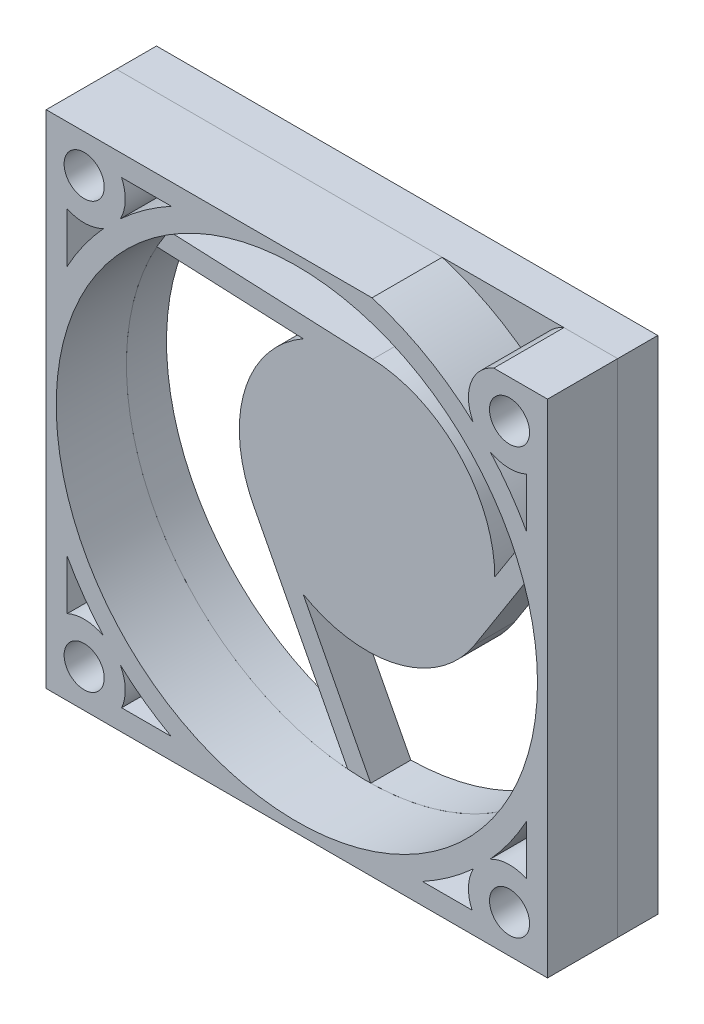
ISO-10303-21;
HEADER;
FILE_DESCRIPTION(('STEP AP214'),'2;1');
FILE_NAME('part.step','',(''),(''),'','','');
FILE_SCHEMA(('AUTOMOTIVE_DESIGN { 1 0 10303 214 1 1 1 1 }'));
ENDSEC;
DATA;
#1=APPLICATION_CONTEXT('core data for automotive mechanical design processes');
#2=APPLICATION_PROTOCOL_DEFINITION('international standard','automotive_design',2000,#1);
#3=PRODUCT_CONTEXT('',#1,'mechanical');
#4=PRODUCT('Part','Part','',(#3));
#5=PRODUCT_RELATED_PRODUCT_CATEGORY('part','',(#4));
#6=PRODUCT_DEFINITION_FORMATION('','',#4);
#7=PRODUCT_DEFINITION_CONTEXT('part definition',#1,'design');
#8=PRODUCT_DEFINITION('design','',#6,#7);
#9=PRODUCT_DEFINITION_SHAPE('','',#8);
#10=(LENGTH_UNIT() NAMED_UNIT(*) SI_UNIT(.MILLI.,.METRE.));
#11=(NAMED_UNIT(*) PLANE_ANGLE_UNIT() SI_UNIT($,.RADIAN.));
#12=(NAMED_UNIT(*) SI_UNIT($,.STERADIAN.) SOLID_ANGLE_UNIT());
#13=UNCERTAINTY_MEASURE_WITH_UNIT(LENGTH_MEASURE(1.E-05),#10,'distance_accuracy_value','');
#14=(GEOMETRIC_REPRESENTATION_CONTEXT(3) GLOBAL_UNCERTAINTY_ASSIGNED_CONTEXT((#13)) GLOBAL_UNIT_ASSIGNED_CONTEXT((#10,
#11,#12)) REPRESENTATION_CONTEXT('',''));
#15=CARTESIAN_POINT('',(0.,0.,0.));
#16=DIRECTION('',(0.,0.,1.));
#17=DIRECTION('',(1.,0.,0.));
#18=AXIS2_PLACEMENT_3D('',#15,#16,#17);
#19=CARTESIAN_POINT('',(-25.,25.,-4.));
#20=DIRECTION('',(-1.,0.,0.));
#21=DIRECTION('',(0.,0.,1.));
#22=AXIS2_PLACEMENT_3D('',#19,#20,#21);
#23=PLANE('',#22);
#24=DIRECTION('',(0.,-1.,0.));
#25=VECTOR('',#24,1.);
#26=CARTESIAN_POINT('',(-25.,25.,0.));
#27=LINE('',#26,#25);
#28=CARTESIAN_POINT('',(-25.,25.,0.));
#29=VERTEX_POINT('',#28);
#30=CARTESIAN_POINT('',(-25.,-25.,0.));
#31=VERTEX_POINT('',#30);
#32=EDGE_CURVE('E253',#29,#31,#27,.T.);
#33=ORIENTED_EDGE('',*,*,#32,.F.);
#34=DIRECTION('',(0.,0.,1.));
#35=VECTOR('',#34,1.);
#36=CARTESIAN_POINT('',(-25.,25.,-4.));
#37=LINE('',#36,#35);
#38=CARTESIAN_POINT('',(-25.,25.,-4.));
#39=VERTEX_POINT('',#38);
#40=EDGE_CURVE('E12',#39,#29,#37,.T.);
#41=ORIENTED_EDGE('',*,*,#40,.F.);
#42=DIRECTION('',(0.,-1.,0.));
#43=VECTOR('',#42,1.);
#44=CARTESIAN_POINT('',(-25.,25.,-4.));
#45=LINE('',#44,#43);
#46=CARTESIAN_POINT('',(-25.,-25.,-4.));
#47=VERTEX_POINT('',#46);
#48=EDGE_CURVE('E260',#39,#47,#45,.T.);
#49=ORIENTED_EDGE('',*,*,#48,.T.);
#50=DIRECTION('',(0.,0.,1.));
#51=VECTOR('',#50,1.);
#52=CARTESIAN_POINT('',(-25.,-25.,-4.));
#53=LINE('',#52,#51);
#54=EDGE_CURVE('E44',#47,#31,#53,.T.);
#55=ORIENTED_EDGE('',*,*,#54,.T.);
#56=EDGE_LOOP('',(#33,#41,#49,#55));
#57=FACE_BOUND('',#56,.T.);
#58=ADVANCED_FACE('F41',(#57),#23,.T.);
#59=CARTESIAN_POINT('',(-25.,25.,-4.));
#60=DIRECTION('',(0.,1.,0.));
#61=DIRECTION('',(0.,0.,1.));
#62=AXIS2_PLACEMENT_3D('',#59,#60,#61);
#63=PLANE('',#62);
#64=DIRECTION('',(-1.,0.,0.));
#65=VECTOR('',#64,1.);
#66=CARTESIAN_POINT('',(-25.,25.,0.));
#67=LINE('',#66,#65);
#68=CARTESIAN_POINT('',(25.,25.,0.));
#69=VERTEX_POINT('',#68);
#70=EDGE_CURVE('E264',#69,#29,#67,.T.);
#71=ORIENTED_EDGE('',*,*,#70,.F.);
#72=DIRECTION('',(0.,0.,1.));
#73=VECTOR('',#72,1.);
#74=CARTESIAN_POINT('',(25.,25.,-4.));
#75=LINE('',#74,#73);
#76=CARTESIAN_POINT('',(25.,25.,-4.));
#77=VERTEX_POINT('',#76);
#78=EDGE_CURVE('E49',#77,#69,#75,.T.);
#79=ORIENTED_EDGE('',*,*,#78,.F.);
#80=DIRECTION('',(-1.,0.,0.));
#81=VECTOR('',#80,1.);
#82=CARTESIAN_POINT('',(-25.,25.,-4.));
#83=LINE('',#82,#81);
#84=EDGE_CURVE('E270',#77,#39,#83,.T.);
#85=ORIENTED_EDGE('',*,*,#84,.T.);
#86=ORIENTED_EDGE('',*,*,#40,.T.);
#87=EDGE_LOOP('',(#71,#79,#85,#86));
#88=FACE_BOUND('',#87,.T.);
#89=ADVANCED_FACE('F296',(#88),#63,.T.);
#90=CARTESIAN_POINT('',(25.,25.,-4.));
#91=DIRECTION('',(1.,0.,0.));
#92=DIRECTION('',(0.,0.,-1.));
#93=AXIS2_PLACEMENT_3D('',#90,#91,#92);
#94=PLANE('',#93);
#95=DIRECTION('',(0.,1.,0.));
#96=VECTOR('',#95,1.);
#97=CARTESIAN_POINT('',(25.,25.,0.));
#98=LINE('',#97,#96);
#99=CARTESIAN_POINT('',(25.,-25.,0.));
#100=VERTEX_POINT('',#99);
#101=EDGE_CURVE('E278',#100,#69,#98,.T.);
#102=ORIENTED_EDGE('',*,*,#101,.F.);
#103=DIRECTION('',(0.,0.,1.));
#104=VECTOR('',#103,1.);
#105=CARTESIAN_POINT('',(25.,-25.,-4.));
#106=LINE('',#105,#104);
#107=CARTESIAN_POINT('',(25.,-25.,-4.));
#108=VERTEX_POINT('',#107);
#109=EDGE_CURVE('E282',#108,#100,#106,.T.);
#110=ORIENTED_EDGE('',*,*,#109,.F.);
#111=DIRECTION('',(0.,1.,0.));
#112=VECTOR('',#111,1.);
#113=CARTESIAN_POINT('',(25.,25.,-4.));
#114=LINE('',#113,#112);
#115=EDGE_CURVE('E267',#108,#77,#114,.T.);
#116=ORIENTED_EDGE('',*,*,#115,.T.);
#117=ORIENTED_EDGE('',*,*,#78,.T.);
#118=EDGE_LOOP('',(#102,#110,#116,#117));
#119=FACE_BOUND('',#118,.T.);
#120=ADVANCED_FACE('F301',(#119),#94,.T.);
#121=CARTESIAN_POINT('',(-25.,-25.,-4.));
#122=DIRECTION('',(0.,-1.,0.));
#123=DIRECTION('',(0.,0.,-1.));
#124=AXIS2_PLACEMENT_3D('',#121,#122,#123);
#125=PLANE('',#124);
#126=DIRECTION('',(1.,0.,0.));
#127=VECTOR('',#126,1.);
#128=CARTESIAN_POINT('',(-25.,-25.,0.));
#129=LINE('',#128,#127);
#130=EDGE_CURVE('E275',#31,#100,#129,.T.);
#131=ORIENTED_EDGE('',*,*,#130,.F.);
#132=ORIENTED_EDGE('',*,*,#54,.F.);
#133=DIRECTION('',(1.,0.,0.));
#134=VECTOR('',#133,1.);
#135=CARTESIAN_POINT('',(-25.,-25.,-4.));
#136=LINE('',#135,#134);
#137=EDGE_CURVE('E263',#47,#108,#136,.T.);
#138=ORIENTED_EDGE('',*,*,#137,.T.);
#139=ORIENTED_EDGE('',*,*,#109,.T.);
#140=EDGE_LOOP('',(#131,#132,#138,#139));
#141=FACE_BOUND('',#140,.T.);
#142=ADVANCED_FACE('F290',(#141),#125,.T.);
#143=CARTESIAN_POINT('',(-25.,-25.,-4.));
#144=DIRECTION('',(0.,0.,1.));
#145=DIRECTION('',(1.,0.,0.));
#146=AXIS2_PLACEMENT_3D('',#143,#144,#145);
#147=PLANE('',#146);
#148=CARTESIAN_POINT('',(-21.2132034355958,-21.2132034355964,-4.));
#149=DIRECTION('',(0.,0.,1.));
#150=DIRECTION('',(1.,0.,0.));
#151=AXIS2_PLACEMENT_3D('',#148,#149,#150);
#152=CIRCLE('',#151,2.00000000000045);
#153=CARTESIAN_POINT('',(-19.2132034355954,-21.2132034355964,-4.));
#154=VERTEX_POINT('',#153);
#155=EDGE_CURVE('E501',#154,#154,#152,.T.);
#156=ORIENTED_EDGE('',*,*,#155,.T.);
#157=EDGE_LOOP('',(#156));
#158=FACE_BOUND('',#157,.T.);
#159=CARTESIAN_POINT('',(21.213203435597,-21.2132034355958,-4.));
#160=DIRECTION('',(0.,0.,1.));
#161=DIRECTION('',(1.,0.,0.));
#162=AXIS2_PLACEMENT_3D('',#159,#160,#161);
#163=CIRCLE('',#162,2.00000000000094);
#164=CARTESIAN_POINT('',(23.213203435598,-21.2132034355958,-4.));
#165=VERTEX_POINT('',#164);
#166=EDGE_CURVE('E509',#165,#165,#163,.T.);
#167=ORIENTED_EDGE('',*,*,#166,.T.);
#168=EDGE_LOOP('',(#167));
#169=FACE_BOUND('',#168,.T.);
#170=CARTESIAN_POINT('',(21.2132034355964,21.213203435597,-4.));
#171=DIRECTION('',(0.,0.,1.));
#172=DIRECTION('',(1.,0.,0.));
#173=AXIS2_PLACEMENT_3D('',#170,#171,#172);
#174=CIRCLE('',#173,2.00000000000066);
#175=CARTESIAN_POINT('',(23.2132034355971,21.213203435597,-4.));
#176=VERTEX_POINT('',#175);
#177=EDGE_CURVE('E515',#176,#176,#174,.T.);
#178=ORIENTED_EDGE('',*,*,#177,.T.);
#179=EDGE_LOOP('',(#178));
#180=FACE_BOUND('',#179,.T.);
#181=CARTESIAN_POINT('',(-21.2132034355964,21.2132034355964,-4.));
#182=DIRECTION('',(0.,0.,1.));
#183=DIRECTION('',(1.,0.,0.));
#184=AXIS2_PLACEMENT_3D('',#181,#182,#183);
#185=CIRCLE('',#184,2.);
#186=CARTESIAN_POINT('',(-19.2132034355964,21.2132034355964,-4.));
#187=VERTEX_POINT('',#186);
#188=EDGE_CURVE('E186',#187,#187,#185,.T.);
#189=ORIENTED_EDGE('',*,*,#188,.T.);
#190=EDGE_LOOP('',(#189));
#191=FACE_BOUND('',#190,.T.);
#192=DIRECTION('',(-0.461110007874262,0.887342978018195,0.));
#193=VECTOR('',#192,1.);
#194=CARTESIAN_POINT('',(-11.3040540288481,-5.87418007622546,-4.));
#195=LINE('',#194,#193);
#196=CARTESIAN_POINT('',(-1.92511307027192,-23.9226658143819,-4.));
#197=VERTEX_POINT('',#196);
#198=CARTESIAN_POINT('',(-11.3040540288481,-5.87418007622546,-4.));
#199=VERTEX_POINT('',#198);
#200=EDGE_CURVE('E163',#197,#199,#195,.T.);
#201=ORIENTED_EDGE('',*,*,#200,.T.);
#202=CARTESIAN_POINT('',(0.,0.,-4.));
#203=DIRECTION('',(0.,0.,-1.));
#204=DIRECTION('',(1.,0.,0.));
#205=AXIS2_PLACEMENT_3D('',#202,#203,#204);
#206=CIRCLE('',#205,12.7392161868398);
#207=CARTESIAN_POINT('',(-6.36960809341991,11.0324848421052,-4.));
#208=VERTEX_POINT('',#207);
#209=EDGE_CURVE('E157',#199,#208,#206,.T.);
#210=ORIENTED_EDGE('',*,*,#209,.T.);
#211=DIRECTION('',(-0.999016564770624,0.0443385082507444,0.));
#212=VECTOR('',#211,1.);
#213=CARTESIAN_POINT('',(-20.9659380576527,11.680301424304,-4.));
#214=LINE('',#213,#212);
#215=CARTESIAN_POINT('',(-20.9659380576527,11.680301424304,-4.));
#216=VERTEX_POINT('',#215);
#217=EDGE_CURVE('E166',#208,#216,#214,.T.);
#218=ORIENTED_EDGE('',*,*,#217,.T.);
#219=CARTESIAN_POINT('',(0.,0.,-4.));
#220=DIRECTION('',(0.,0.,1.));
#221=DIRECTION('',(1.,0.,0.));
#222=AXIS2_PLACEMENT_3D('',#219,#220,#221);
#223=CIRCLE('',#222,23.9999999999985);
#224=EDGE_CURVE('E57',#216,#197,#223,.T.);
#225=ORIENTED_EDGE('',*,*,#224,.T.);
#226=EDGE_LOOP('',(#201,#210,#218,#225));
#227=FACE_BOUND('',#226,.T.);
#228=DIRECTION('',(0.999016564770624,-0.0443385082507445,0.));
#229=VECTOR('',#228,1.);
#230=CARTESIAN_POINT('',(0.564837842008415,12.726687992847,-4.));
#231=LINE('',#230,#229);
#232=CARTESIAN_POINT('',(-19.7550797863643,13.6285297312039,-4.));
#233=VERTEX_POINT('',#232);
#234=CARTESIAN_POINT('',(0.564837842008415,12.726687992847,-4.));
#235=VERTEX_POINT('',#234);
#236=EDGE_CURVE('E206',#233,#235,#231,.T.);
#237=ORIENTED_EDGE('',*,*,#236,.T.);
#238=CARTESIAN_POINT('',(0.,0.,-4.));
#239=DIRECTION('',(0.,0.,-1.));
#240=DIRECTION('',(1.,0.,0.));
#241=AXIS2_PLACEMENT_3D('',#238,#239,#240);
#242=CIRCLE('',#241,12.7392161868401);
#243=CARTESIAN_POINT('',(12.7392161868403,0.,-4.));
#244=VERTEX_POINT('',#243);
#245=EDGE_CURVE('E196',#235,#244,#242,.T.);
#246=ORIENTED_EDGE('',*,*,#245,.T.);
#247=DIRECTION('',(0.537906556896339,0.843004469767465,0.));
#248=VECTOR('',#247,1.);
#249=CARTESIAN_POINT('',(20.5984067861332,12.3168842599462,-4.));
#250=LINE('',#249,#248);
#251=CARTESIAN_POINT('',(20.5984067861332,12.3168842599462,-4.));
#252=VERTEX_POINT('',#251);
#253=EDGE_CURVE('E199',#244,#252,#250,.T.);
#254=ORIENTED_EDGE('',*,*,#253,.T.);
#255=CARTESIAN_POINT('',(0.,0.,-4.));
#256=DIRECTION('',(0.,0.,1.));
#257=DIRECTION('',(1.,0.,0.));
#258=AXIS2_PLACEMENT_3D('',#255,#256,#257);
#259=CIRCLE('',#258,23.9999999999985);
#260=EDGE_CURVE('E203',#252,#233,#259,.T.);
#261=ORIENTED_EDGE('',*,*,#260,.T.);
#262=EDGE_LOOP('',(#237,#246,#254,#261));
#263=FACE_BOUND('',#262,.T.);
#264=DIRECTION('',(-0.537906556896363,-0.84300446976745,0.));
#265=VECTOR('',#264,1.);
#266=CARTESIAN_POINT('',(10.7392161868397,-6.85250791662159,-4.));
#267=LINE('',#266,#265);
#268=CARTESIAN_POINT('',(21.6801928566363,10.294136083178,-4.));
#269=VERTEX_POINT('',#268);
#270=CARTESIAN_POINT('',(10.7392161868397,-6.85250791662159,-4.));
#271=VERTEX_POINT('',#270);
#272=EDGE_CURVE('E238',#269,#271,#267,.T.);
#273=ORIENTED_EDGE('',*,*,#272,.T.);
#274=CARTESIAN_POINT('',(0.,0.,-4.));
#275=DIRECTION('',(0.,0.,-1.));
#276=DIRECTION('',(1.,0.,0.));
#277=AXIS2_PLACEMENT_3D('',#274,#275,#276);
#278=CIRCLE('',#277,12.7392161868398);
#279=CARTESIAN_POINT('',(-6.36960809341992,-11.0324848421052,-4.));
#280=VERTEX_POINT('',#279);
#281=EDGE_CURVE('E228',#271,#280,#278,.T.);
#282=ORIENTED_EDGE('',*,*,#281,.T.);
#283=DIRECTION('',(0.461110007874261,-0.887342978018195,0.));
#284=VECTOR('',#283,1.);
#285=CARTESIAN_POINT('',(0.367531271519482,-23.9971856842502,-4.));
#286=LINE('',#285,#284);
#287=CARTESIAN_POINT('',(0.36753127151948,-23.9971856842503,-4.));
#288=VERTEX_POINT('',#287);
#289=EDGE_CURVE('E231',#280,#288,#286,.T.);
#290=ORIENTED_EDGE('',*,*,#289,.T.);
#291=CARTESIAN_POINT('',(0.,0.,-4.));
#292=DIRECTION('',(0.,0.,1.));
#293=DIRECTION('',(1.,0.,0.));
#294=AXIS2_PLACEMENT_3D('',#291,#292,#293);
#295=CIRCLE('',#294,23.9999999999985);
#296=EDGE_CURVE('E235',#288,#269,#295,.T.);
#297=ORIENTED_EDGE('',*,*,#296,.T.);
#298=EDGE_LOOP('',(#273,#282,#290,#297));
#299=FACE_BOUND('',#298,.T.);
#300=ORIENTED_EDGE('',*,*,#48,.F.);
#301=ORIENTED_EDGE('',*,*,#84,.F.);
#302=ORIENTED_EDGE('',*,*,#115,.F.);
#303=ORIENTED_EDGE('',*,*,#137,.F.);
#304=EDGE_LOOP('',(#300,#301,#302,#303));
#305=FACE_BOUND('',#304,.T.);
#306=ADVANCED_FACE('F170',(#158,#169,#180,#191,#227,#263,#299,#305),#147,.F.);
#307=CARTESIAN_POINT('',(-25.,-25.,0.));
#308=DIRECTION('',(0.,0.,1.));
#309=DIRECTION('',(1.,0.,0.));
#310=AXIS2_PLACEMENT_3D('',#307,#308,#309);
#311=PLANE('',#310);
#312=ORIENTED_EDGE('',*,*,#70,.T.);
#313=ORIENTED_EDGE('',*,*,#32,.T.);
#314=ORIENTED_EDGE('',*,*,#130,.T.);
#315=ORIENTED_EDGE('',*,*,#101,.T.);
#316=EDGE_LOOP('',(#312,#313,#314,#315));
#317=FACE_BOUND('',#316,.T.);
#318=CARTESIAN_POINT('',(-21.2132034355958,-21.2132034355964,0.));
#319=DIRECTION('',(0.,0.,1.));
#320=DIRECTION('',(1.,0.,0.));
#321=AXIS2_PLACEMENT_3D('',#318,#319,#320);
#322=CIRCLE('',#321,2.00000000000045);
#323=CARTESIAN_POINT('',(-19.2132034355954,-21.2132034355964,0.));
#324=VERTEX_POINT('',#323);
#325=EDGE_CURVE('E504',#324,#324,#322,.T.);
#326=ORIENTED_EDGE('',*,*,#325,.F.);
#327=EDGE_LOOP('',(#326));
#328=FACE_BOUND('',#327,.T.);
#329=CARTESIAN_POINT('',(21.213203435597,-21.2132034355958,0.));
#330=DIRECTION('',(0.,0.,1.));
#331=DIRECTION('',(1.,0.,0.));
#332=AXIS2_PLACEMENT_3D('',#329,#330,#331);
#333=CIRCLE('',#332,2.00000000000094);
#334=CARTESIAN_POINT('',(23.213203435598,-21.2132034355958,0.));
#335=VERTEX_POINT('',#334);
#336=EDGE_CURVE('E506',#335,#335,#333,.T.);
#337=ORIENTED_EDGE('',*,*,#336,.F.);
#338=EDGE_LOOP('',(#337));
#339=FACE_BOUND('',#338,.T.);
#340=CARTESIAN_POINT('',(21.2132034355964,21.213203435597,0.));
#341=DIRECTION('',(0.,0.,1.));
#342=DIRECTION('',(1.,0.,0.));
#343=AXIS2_PLACEMENT_3D('',#340,#341,#342);
#344=CIRCLE('',#343,2.00000000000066);
#345=CARTESIAN_POINT('',(23.2132034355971,21.213203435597,0.));
#346=VERTEX_POINT('',#345);
#347=EDGE_CURVE('E512',#346,#346,#344,.T.);
#348=ORIENTED_EDGE('',*,*,#347,.F.);
#349=EDGE_LOOP('',(#348));
#350=FACE_BOUND('',#349,.T.);
#351=CARTESIAN_POINT('',(-21.2132034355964,21.2132034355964,0.));
#352=DIRECTION('',(0.,0.,1.));
#353=DIRECTION('',(1.,0.,0.));
#354=AXIS2_PLACEMENT_3D('',#351,#352,#353);
#355=CIRCLE('',#354,2.);
#356=CARTESIAN_POINT('',(-19.2132034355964,21.2132034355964,0.));
#357=VERTEX_POINT('',#356);
#358=EDGE_CURVE('E179',#357,#357,#355,.T.);
#359=ORIENTED_EDGE('',*,*,#358,.F.);
#360=EDGE_LOOP('',(#359));
#361=FACE_BOUND('',#360,.T.);
#362=CARTESIAN_POINT('',(0.,0.,0.));
#363=DIRECTION('',(0.,0.,-1.));
#364=DIRECTION('',(1.,0.,0.));
#365=AXIS2_PLACEMENT_3D('',#362,#363,#364);
#366=CIRCLE('',#365,12.7392161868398);
#367=CARTESIAN_POINT('',(-11.3040540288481,-5.87418007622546,0.));
#368=VERTEX_POINT('',#367);
#369=CARTESIAN_POINT('',(-6.36960809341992,11.0324848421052,0.));
#370=VERTEX_POINT('',#369);
#371=EDGE_CURVE('E65',#368,#370,#366,.T.);
#372=ORIENTED_EDGE('',*,*,#371,.F.);
#373=DIRECTION('',(-0.461110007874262,0.887342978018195,0.));
#374=VECTOR('',#373,1.);
#375=CARTESIAN_POINT('',(-11.3040540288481,-5.87418007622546,0.));
#376=LINE('',#375,#374);
#377=CARTESIAN_POINT('',(-1.92511307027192,-23.9226658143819,0.));
#378=VERTEX_POINT('',#377);
#379=EDGE_CURVE('E173',#378,#368,#376,.T.);
#380=ORIENTED_EDGE('',*,*,#379,.F.);
#381=CARTESIAN_POINT('',(0.,0.,0.));
#382=DIRECTION('',(0.,0.,1.));
#383=DIRECTION('',(1.,0.,0.));
#384=AXIS2_PLACEMENT_3D('',#381,#382,#383);
#385=CIRCLE('',#384,23.9999999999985);
#386=CARTESIAN_POINT('',(-20.9659380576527,11.6803014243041,0.));
#387=VERTEX_POINT('',#386);
#388=EDGE_CURVE('E176',#387,#378,#385,.T.);
#389=ORIENTED_EDGE('',*,*,#388,.F.);
#390=DIRECTION('',(-0.999016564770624,0.0443385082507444,0.));
#391=VECTOR('',#390,1.);
#392=CARTESIAN_POINT('',(-20.9659380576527,11.680301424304,0.));
#393=LINE('',#392,#391);
#394=EDGE_CURVE('E185',#370,#387,#393,.T.);
#395=ORIENTED_EDGE('',*,*,#394,.F.);
#396=EDGE_LOOP('',(#372,#380,#389,#395));
#397=FACE_BOUND('',#396,.T.);
#398=CARTESIAN_POINT('',(0.,0.,0.));
#399=DIRECTION('',(0.,0.,-1.));
#400=DIRECTION('',(1.,0.,0.));
#401=AXIS2_PLACEMENT_3D('',#398,#399,#400);
#402=CIRCLE('',#401,12.7392161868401);
#403=CARTESIAN_POINT('',(0.564837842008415,12.726687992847,0.));
#404=VERTEX_POINT('',#403);
#405=CARTESIAN_POINT('',(12.7392161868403,0.,0.));
#406=VERTEX_POINT('',#405);
#407=EDGE_CURVE('E192',#404,#406,#402,.T.);
#408=ORIENTED_EDGE('',*,*,#407,.F.);
#409=DIRECTION('',(0.999016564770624,-0.0443385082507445,0.));
#410=VECTOR('',#409,1.);
#411=CARTESIAN_POINT('',(0.564837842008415,12.726687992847,0.));
#412=LINE('',#411,#410);
#413=CARTESIAN_POINT('',(-19.7550797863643,13.6285297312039,0.));
#414=VERTEX_POINT('',#413);
#415=EDGE_CURVE('E200',#414,#404,#412,.T.);
#416=ORIENTED_EDGE('',*,*,#415,.F.);
#417=CARTESIAN_POINT('',(0.,0.,0.));
#418=DIRECTION('',(0.,0.,1.));
#419=DIRECTION('',(1.,0.,0.));
#420=AXIS2_PLACEMENT_3D('',#417,#418,#419);
#421=CIRCLE('',#420,23.9999999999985);
#422=CARTESIAN_POINT('',(20.5984067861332,12.3168842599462,0.));
#423=VERTEX_POINT('',#422);
#424=EDGE_CURVE('E214',#423,#414,#421,.T.);
#425=ORIENTED_EDGE('',*,*,#424,.F.);
#426=DIRECTION('',(0.537906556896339,0.843004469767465,0.));
#427=VECTOR('',#426,1.);
#428=CARTESIAN_POINT('',(20.5984067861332,12.3168842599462,0.));
#429=LINE('',#428,#427);
#430=EDGE_CURVE('E211',#406,#423,#429,.T.);
#431=ORIENTED_EDGE('',*,*,#430,.F.);
#432=EDGE_LOOP('',(#408,#416,#425,#431));
#433=FACE_BOUND('',#432,.T.);
#434=CARTESIAN_POINT('',(0.,0.,0.));
#435=DIRECTION('',(0.,0.,-1.));
#436=DIRECTION('',(1.,0.,0.));
#437=AXIS2_PLACEMENT_3D('',#434,#435,#436);
#438=CIRCLE('',#437,12.7392161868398);
#439=CARTESIAN_POINT('',(10.7392161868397,-6.85250791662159,0.));
#440=VERTEX_POINT('',#439);
#441=CARTESIAN_POINT('',(-6.36960809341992,-11.0324848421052,0.));
#442=VERTEX_POINT('',#441);
#443=EDGE_CURVE('E221',#440,#442,#438,.T.);
#444=ORIENTED_EDGE('',*,*,#443,.F.);
#445=DIRECTION('',(-0.537906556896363,-0.84300446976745,0.));
#446=VECTOR('',#445,1.);
#447=CARTESIAN_POINT('',(10.7392161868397,-6.85250791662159,0.));
#448=LINE('',#447,#446);
#449=CARTESIAN_POINT('',(21.6801928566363,10.294136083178,0.));
#450=VERTEX_POINT('',#449);
#451=EDGE_CURVE('E232',#450,#440,#448,.T.);
#452=ORIENTED_EDGE('',*,*,#451,.F.);
#453=CARTESIAN_POINT('',(0.,0.,0.));
#454=DIRECTION('',(0.,0.,1.));
#455=DIRECTION('',(1.,0.,0.));
#456=AXIS2_PLACEMENT_3D('',#453,#454,#455);
#457=CIRCLE('',#456,23.9999999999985);
#458=CARTESIAN_POINT('',(0.367531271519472,-23.9971856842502,0.));
#459=VERTEX_POINT('',#458);
#460=EDGE_CURVE('E246',#459,#450,#457,.T.);
#461=ORIENTED_EDGE('',*,*,#460,.F.);
#462=DIRECTION('',(0.461110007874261,-0.887342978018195,0.));
#463=VECTOR('',#462,1.);
#464=CARTESIAN_POINT('',(0.367531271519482,-23.9971856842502,0.));
#465=LINE('',#464,#463);
#466=EDGE_CURVE('E243',#442,#459,#465,.T.);
#467=ORIENTED_EDGE('',*,*,#466,.F.);
#468=EDGE_LOOP('',(#444,#452,#461,#467));
#469=FACE_BOUND('',#468,.T.);
#470=ADVANCED_FACE('F292',(#317,#328,#339,#350,#361,#397,#433,#469),#311,.T.);
#471=CARTESIAN_POINT('',(0.,0.,-4.));
#472=DIRECTION('',(0.,0.,1.));
#473=DIRECTION('',(1.,0.,0.));
#474=AXIS2_PLACEMENT_3D('',#471,#472,#473);
#475=CYLINDRICAL_SURFACE('',#474,12.7392161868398);
#476=ORIENTED_EDGE('',*,*,#443,.T.);
#477=DIRECTION('',(0.,0.,1.));
#478=VECTOR('',#477,1.);
#479=CARTESIAN_POINT('',(-6.36960809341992,-11.0324848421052,-4.));
#480=LINE('',#479,#478);
#481=EDGE_CURVE('E241',#280,#442,#480,.T.);
#482=ORIENTED_EDGE('',*,*,#481,.F.);
#483=ORIENTED_EDGE('',*,*,#281,.F.);
#484=DIRECTION('',(0.,0.,1.));
#485=VECTOR('',#484,1.);
#486=CARTESIAN_POINT('',(10.7392161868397,-6.85250791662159,-4.));
#487=LINE('',#486,#485);
#488=EDGE_CURVE('E251',#271,#440,#487,.T.);
#489=ORIENTED_EDGE('',*,*,#488,.T.);
#490=EDGE_LOOP('',(#476,#482,#483,#489));
#491=FACE_BOUND('',#490,.T.);
#492=ADVANCED_FACE('F343',(#491),#475,.T.);
#493=CARTESIAN_POINT('',(10.7392161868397,-6.85250791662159,-4.));
#494=DIRECTION('',(-0.84300446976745,0.537906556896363,0.));
#495=DIRECTION('',(-0.537906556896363,-0.84300446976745,0.));
#496=AXIS2_PLACEMENT_3D('',#493,#494,#495);
#497=PLANE('',#496);
#498=ORIENTED_EDGE('',*,*,#451,.T.);
#499=ORIENTED_EDGE('',*,*,#488,.F.);
#500=ORIENTED_EDGE('',*,*,#272,.F.);
#501=DIRECTION('',(0.,0.,1.));
#502=VECTOR('',#501,1.);
#503=CARTESIAN_POINT('',(21.6801928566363,10.294136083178,-4.));
#504=LINE('',#503,#502);
#505=EDGE_CURVE('E254',#269,#450,#504,.T.);
#506=ORIENTED_EDGE('',*,*,#505,.T.);
#507=EDGE_LOOP('',(#498,#499,#500,#506));
#508=FACE_BOUND('',#507,.T.);
#509=ADVANCED_FACE('F350',(#508),#497,.F.);
#510=CARTESIAN_POINT('',(0.,0.,-4.));
#511=DIRECTION('',(0.,0.,1.));
#512=DIRECTION('',(1.,0.,0.));
#513=AXIS2_PLACEMENT_3D('',#510,#511,#512);
#514=CYLINDRICAL_SURFACE('',#513,23.9999999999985);
#515=ORIENTED_EDGE('',*,*,#460,.T.);
#516=ORIENTED_EDGE('',*,*,#505,.F.);
#517=ORIENTED_EDGE('',*,*,#296,.F.);
#518=DIRECTION('',(0.,0.,1.));
#519=VECTOR('',#518,1.);
#520=CARTESIAN_POINT('',(0.367531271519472,-23.9971856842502,-4.));
#521=LINE('',#520,#519);
#522=EDGE_CURVE('E256',#288,#459,#521,.T.);
#523=ORIENTED_EDGE('',*,*,#522,.T.);
#524=EDGE_LOOP('',(#515,#516,#517,#523));
#525=FACE_BOUND('',#524,.T.);
#526=ADVANCED_FACE('F359',(#525),#514,.F.);
#527=CARTESIAN_POINT('',(0.367531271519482,-23.9971856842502,-4.));
#528=DIRECTION('',(-0.887342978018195,-0.461110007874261,0.));
#529=DIRECTION('',(0.461110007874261,-0.887342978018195,0.));
#530=AXIS2_PLACEMENT_3D('',#527,#528,#529);
#531=PLANE('',#530);
#532=ORIENTED_EDGE('',*,*,#466,.T.);
#533=ORIENTED_EDGE('',*,*,#522,.F.);
#534=ORIENTED_EDGE('',*,*,#289,.F.);
#535=ORIENTED_EDGE('',*,*,#481,.T.);
#536=EDGE_LOOP('',(#532,#533,#534,#535));
#537=FACE_BOUND('',#536,.T.);
#538=ADVANCED_FACE('F368',(#537),#531,.F.);
#539=CARTESIAN_POINT('',(0.,0.,-4.));
#540=DIRECTION('',(0.,0.,1.));
#541=DIRECTION('',(1.,0.,0.));
#542=AXIS2_PLACEMENT_3D('',#539,#540,#541);
#543=CYLINDRICAL_SURFACE('',#542,12.7392161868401);
#544=ORIENTED_EDGE('',*,*,#407,.T.);
#545=DIRECTION('',(0.,0.,1.));
#546=VECTOR('',#545,1.);
#547=CARTESIAN_POINT('',(12.7392161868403,0.,-4.));
#548=LINE('',#547,#546);
#549=EDGE_CURVE('E209',#244,#406,#548,.T.);
#550=ORIENTED_EDGE('',*,*,#549,.F.);
#551=ORIENTED_EDGE('',*,*,#245,.F.);
#552=DIRECTION('',(0.,0.,1.));
#553=VECTOR('',#552,1.);
#554=CARTESIAN_POINT('',(0.564837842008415,12.726687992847,-4.));
#555=LINE('',#554,#553);
#556=EDGE_CURVE('E219',#235,#404,#555,.T.);
#557=ORIENTED_EDGE('',*,*,#556,.T.);
#558=EDGE_LOOP('',(#544,#550,#551,#557));
#559=FACE_BOUND('',#558,.T.);
#560=ADVANCED_FACE('F377',(#559),#543,.T.);
#561=CARTESIAN_POINT('',(0.564837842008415,12.726687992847,-4.));
#562=DIRECTION('',(-0.0443385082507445,-0.999016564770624,0.));
#563=DIRECTION('',(0.999016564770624,-0.0443385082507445,0.));
#564=AXIS2_PLACEMENT_3D('',#561,#562,#563);
#565=PLANE('',#564);
#566=ORIENTED_EDGE('',*,*,#415,.T.);
#567=ORIENTED_EDGE('',*,*,#556,.F.);
#568=ORIENTED_EDGE('',*,*,#236,.F.);
#569=DIRECTION('',(0.,0.,1.));
#570=VECTOR('',#569,1.);
#571=CARTESIAN_POINT('',(-19.7550797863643,13.6285297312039,-4.));
#572=LINE('',#571,#570);
#573=EDGE_CURVE('E222',#233,#414,#572,.T.);
#574=ORIENTED_EDGE('',*,*,#573,.T.);
#575=EDGE_LOOP('',(#566,#567,#568,#574));
#576=FACE_BOUND('',#575,.T.);
#577=ADVANCED_FACE('F386',(#576),#565,.F.);
#578=CARTESIAN_POINT('',(0.,0.,-4.));
#579=DIRECTION('',(0.,0.,1.));
#580=DIRECTION('',(1.,0.,0.));
#581=AXIS2_PLACEMENT_3D('',#578,#579,#580);
#582=CYLINDRICAL_SURFACE('',#581,23.9999999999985);
#583=ORIENTED_EDGE('',*,*,#424,.T.);
#584=ORIENTED_EDGE('',*,*,#573,.F.);
#585=ORIENTED_EDGE('',*,*,#260,.F.);
#586=DIRECTION('',(0.,0.,1.));
#587=VECTOR('',#586,1.);
#588=CARTESIAN_POINT('',(20.5984067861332,12.3168842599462,-4.));
#589=LINE('',#588,#587);
#590=EDGE_CURVE('E224',#252,#423,#589,.T.);
#591=ORIENTED_EDGE('',*,*,#590,.T.);
#592=EDGE_LOOP('',(#583,#584,#585,#591));
#593=FACE_BOUND('',#592,.T.);
#594=ADVANCED_FACE('F395',(#593),#582,.F.);
#595=CARTESIAN_POINT('',(20.5984067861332,12.3168842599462,-4.));
#596=DIRECTION('',(0.843004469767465,-0.537906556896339,0.));
#597=DIRECTION('',(0.537906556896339,0.843004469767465,0.));
#598=AXIS2_PLACEMENT_3D('',#595,#596,#597);
#599=PLANE('',#598);
#600=ORIENTED_EDGE('',*,*,#430,.T.);
#601=ORIENTED_EDGE('',*,*,#590,.F.);
#602=ORIENTED_EDGE('',*,*,#253,.F.);
#603=ORIENTED_EDGE('',*,*,#549,.T.);
#604=EDGE_LOOP('',(#600,#601,#602,#603));
#605=FACE_BOUND('',#604,.T.);
#606=ADVANCED_FACE('F404',(#605),#599,.F.);
#607=CARTESIAN_POINT('',(0.,0.,-4.));
#608=DIRECTION('',(0.,0.,1.));
#609=DIRECTION('',(1.,0.,0.));
#610=AXIS2_PLACEMENT_3D('',#607,#608,#609);
#611=CYLINDRICAL_SURFACE('',#610,12.7392161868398);
#612=ORIENTED_EDGE('',*,*,#371,.T.);
#613=DIRECTION('',(0.,0.,1.));
#614=VECTOR('',#613,1.);
#615=CARTESIAN_POINT('',(-6.36960809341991,11.0324848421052,-4.));
#616=LINE('',#615,#614);
#617=EDGE_CURVE('E153',#208,#370,#616,.T.);
#618=ORIENTED_EDGE('',*,*,#617,.F.);
#619=ORIENTED_EDGE('',*,*,#209,.F.);
#620=DIRECTION('',(0.,0.,1.));
#621=VECTOR('',#620,1.);
#622=CARTESIAN_POINT('',(-11.3040540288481,-5.87418007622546,-4.));
#623=LINE('',#622,#621);
#624=EDGE_CURVE('E190',#199,#368,#623,.T.);
#625=ORIENTED_EDGE('',*,*,#624,.T.);
#626=EDGE_LOOP('',(#612,#618,#619,#625));
#627=FACE_BOUND('',#626,.T.);
#628=ADVANCED_FACE('F155',(#627),#611,.T.);
#629=CARTESIAN_POINT('',(-11.3040540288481,-5.87418007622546,-4.));
#630=DIRECTION('',(0.887342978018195,0.461110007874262,0.));
#631=DIRECTION('',(-0.461110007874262,0.887342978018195,0.));
#632=AXIS2_PLACEMENT_3D('',#629,#630,#631);
#633=PLANE('',#632);
#634=ORIENTED_EDGE('',*,*,#379,.T.);
#635=ORIENTED_EDGE('',*,*,#624,.F.);
#636=ORIENTED_EDGE('',*,*,#200,.F.);
#637=DIRECTION('',(0.,0.,1.));
#638=VECTOR('',#637,1.);
#639=CARTESIAN_POINT('',(-1.92511307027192,-23.9226658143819,-4.));
#640=LINE('',#639,#638);
#641=EDGE_CURVE('E193',#197,#378,#640,.T.);
#642=ORIENTED_EDGE('',*,*,#641,.T.);
#643=EDGE_LOOP('',(#634,#635,#636,#642));
#644=FACE_BOUND('',#643,.T.);
#645=ADVANCED_FACE('F421',(#644),#633,.F.);
#646=CARTESIAN_POINT('',(0.,0.,-4.));
#647=DIRECTION('',(0.,0.,1.));
#648=DIRECTION('',(1.,0.,0.));
#649=AXIS2_PLACEMENT_3D('',#646,#647,#648);
#650=CYLINDRICAL_SURFACE('',#649,23.9999999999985);
#651=ORIENTED_EDGE('',*,*,#388,.T.);
#652=ORIENTED_EDGE('',*,*,#641,.F.);
#653=ORIENTED_EDGE('',*,*,#224,.F.);
#654=DIRECTION('',(0.,0.,1.));
#655=VECTOR('',#654,1.);
#656=CARTESIAN_POINT('',(-20.9659380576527,11.6803014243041,-4.));
#657=LINE('',#656,#655);
#658=EDGE_CURVE('E162',#216,#387,#657,.T.);
#659=ORIENTED_EDGE('',*,*,#658,.T.);
#660=EDGE_LOOP('',(#651,#652,#653,#659));
#661=FACE_BOUND('',#660,.T.);
#662=ADVANCED_FACE('F429',(#661),#650,.F.);
#663=CARTESIAN_POINT('',(-20.9659380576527,11.680301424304,-4.));
#664=DIRECTION('',(0.0443385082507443,0.999016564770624,0.));
#665=DIRECTION('',(-0.999016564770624,0.0443385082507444,0.));
#666=AXIS2_PLACEMENT_3D('',#663,#664,#665);
#667=PLANE('',#666);
#668=ORIENTED_EDGE('',*,*,#394,.T.);
#669=ORIENTED_EDGE('',*,*,#658,.F.);
#670=ORIENTED_EDGE('',*,*,#217,.F.);
#671=ORIENTED_EDGE('',*,*,#617,.T.);
#672=EDGE_LOOP('',(#668,#669,#670,#671));
#673=FACE_BOUND('',#672,.T.);
#674=ADVANCED_FACE('F167',(#673),#667,.F.);
#675=CARTESIAN_POINT('',(-21.2132034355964,21.2132034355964,-4.));
#676=DIRECTION('',(0.,0.,1.));
#677=DIRECTION('',(1.,0.,0.));
#678=AXIS2_PLACEMENT_3D('',#675,#676,#677);
#679=CYLINDRICAL_SURFACE('',#678,2.);
#680=ORIENTED_EDGE('',*,*,#188,.F.);
#681=EDGE_LOOP('',(#680));
#682=FACE_BOUND('',#681,.T.);
#683=ORIENTED_EDGE('',*,*,#358,.T.);
#684=EDGE_LOOP('',(#683));
#685=FACE_BOUND('',#684,.T.);
#686=ADVANCED_FACE('F445',(#682,#685),#679,.F.);
#687=CARTESIAN_POINT('',(21.2132034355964,21.213203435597,-4.));
#688=DIRECTION('',(0.,0.,1.));
#689=DIRECTION('',(1.,0.,0.));
#690=AXIS2_PLACEMENT_3D('',#687,#688,#689);
#691=CYLINDRICAL_SURFACE('',#690,2.00000000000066);
#692=ORIENTED_EDGE('',*,*,#177,.F.);
#693=EDGE_LOOP('',(#692));
#694=FACE_BOUND('',#693,.T.);
#695=ORIENTED_EDGE('',*,*,#347,.T.);
#696=EDGE_LOOP('',(#695));
#697=FACE_BOUND('',#696,.T.);
#698=ADVANCED_FACE('F453',(#694,#697),#691,.F.);
#699=CARTESIAN_POINT('',(21.213203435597,-21.2132034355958,-4.));
#700=DIRECTION('',(0.,0.,1.));
#701=DIRECTION('',(1.,0.,0.));
#702=AXIS2_PLACEMENT_3D('',#699,#700,#701);
#703=CYLINDRICAL_SURFACE('',#702,2.00000000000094);
#704=ORIENTED_EDGE('',*,*,#166,.F.);
#705=EDGE_LOOP('',(#704));
#706=FACE_BOUND('',#705,.T.);
#707=ORIENTED_EDGE('',*,*,#336,.T.);
#708=EDGE_LOOP('',(#707));
#709=FACE_BOUND('',#708,.T.);
#710=ADVANCED_FACE('F462',(#706,#709),#703,.F.);
#711=CARTESIAN_POINT('',(-21.2132034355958,-21.2132034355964,-4.));
#712=DIRECTION('',(0.,0.,1.));
#713=DIRECTION('',(1.,0.,0.));
#714=AXIS2_PLACEMENT_3D('',#711,#712,#713);
#715=CYLINDRICAL_SURFACE('',#714,2.00000000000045);
#716=ORIENTED_EDGE('',*,*,#155,.F.);
#717=EDGE_LOOP('',(#716));
#718=FACE_BOUND('',#717,.T.);
#719=ORIENTED_EDGE('',*,*,#325,.T.);
#720=EDGE_LOOP('',(#719));
#721=FACE_BOUND('',#720,.T.);
#722=ADVANCED_FACE('F471',(#718,#721),#715,.F.);
#723=CLOSED_SHELL('',(#58,#89,#120,#142,#306,#470,#492,#509,#526,#538,#560,#577,#594,#606,#628,
#645,#662,#674,#686,#698,#710,#722));
#724=MANIFOLD_SOLID_BREP('B2',#723);
#725=CARTESIAN_POINT('',(-25.,-25.,7.));
#726=DIRECTION('',(0.,0.,1.));
#727=DIRECTION('',(1.,0.,0.));
#728=AXIS2_PLACEMENT_3D('',#725,#726,#727);
#729=PLANE('',#728);
#730=DIRECTION('',(1.,0.,0.));
#731=VECTOR('',#730,1.);
#732=CARTESIAN_POINT('',(-25.,-22.9,7.));
#733=LINE('',#732,#731);
#734=CARTESIAN_POINT('',(-17.4762638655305,-22.9,7.));
#735=VERTEX_POINT('',#734);
#736=CARTESIAN_POINT('',(-12.5219806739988,-22.9,7.));
#737=VERTEX_POINT('',#736);
#738=EDGE_CURVE('E578',#735,#737,#733,.T.);
#739=ORIENTED_EDGE('',*,*,#738,.F.);
#740=CARTESIAN_POINT('',(-21.2132034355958,-21.2132034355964,7.));
#741=DIRECTION('',(0.,0.,1.));
#742=DIRECTION('',(1.,0.,0.));
#743=AXIS2_PLACEMENT_3D('',#740,#741,#742);
#744=CIRCLE('',#743,4.10000000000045);
#745=CARTESIAN_POINT('',(-17.6025777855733,-19.270683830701,7.));
#746=VERTEX_POINT('',#745);
#747=EDGE_CURVE('E783',#735,#746,#744,.T.);
#748=ORIENTED_EDGE('',*,*,#747,.T.);
#749=CARTESIAN_POINT('',(0.,0.,7.));
#750=DIRECTION('',(0.,0.,1.));
#751=DIRECTION('',(1.,0.,0.));
#752=AXIS2_PLACEMENT_3D('',#749,#750,#751);
#753=CIRCLE('',#752,26.1);
#754=EDGE_CURVE('E969',#746,#737,#753,.T.);
#755=ORIENTED_EDGE('',*,*,#754,.T.);
#756=EDGE_LOOP('',(#739,#748,#755));
#757=FACE_BOUND('',#756,.T.);
#758=DIRECTION('',(0.,-1.,0.));
#759=VECTOR('',#758,1.);
#760=CARTESIAN_POINT('',(-22.9,25.,7.));
#761=LINE('',#760,#759);
#762=CARTESIAN_POINT('',(-22.9,17.4762638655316,7.));
#763=VERTEX_POINT('',#762);
#764=CARTESIAN_POINT('',(-22.9,12.5219806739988,7.));
#765=VERTEX_POINT('',#764);
#766=EDGE_CURVE('E821',#763,#765,#761,.T.);
#767=ORIENTED_EDGE('',*,*,#766,.F.);
#768=CARTESIAN_POINT('',(-21.2132034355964,21.2132034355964,7.));
#769=DIRECTION('',(0.,0.,1.));
#770=DIRECTION('',(1.,0.,0.));
#771=AXIS2_PLACEMENT_3D('',#768,#769,#770);
#772=CIRCLE('',#771,4.1);
#773=CARTESIAN_POINT('',(-19.2706838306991,17.6025777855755,7.));
#774=VERTEX_POINT('',#773);
#775=EDGE_CURVE('E835',#763,#774,#772,.T.);
#776=ORIENTED_EDGE('',*,*,#775,.T.);
#777=EDGE_CURVE('E809',#774,#765,#753,.T.);
#778=ORIENTED_EDGE('',*,*,#777,.T.);
#779=EDGE_LOOP('',(#767,#776,#778));
#780=FACE_BOUND('',#779,.T.);
#781=DIRECTION('',(-1.,0.,0.));
#782=VECTOR('',#781,1.);
#783=CARTESIAN_POINT('',(-25.,22.9,7.));
#784=LINE('',#783,#782);
#785=CARTESIAN_POINT('',(-12.5219806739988,22.9,7.));
#786=VERTEX_POINT('',#785);
#787=CARTESIAN_POINT('',(-17.4762638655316,22.9,7.));
#788=VERTEX_POINT('',#787);
#789=EDGE_CURVE('E827',#786,#788,#784,.T.);
#790=ORIENTED_EDGE('',*,*,#789,.F.);
#791=CARTESIAN_POINT('',(-17.6025777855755,19.2706838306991,7.));
#792=VERTEX_POINT('',#791);
#793=EDGE_CURVE('E793',#786,#792,#753,.T.);
#794=ORIENTED_EDGE('',*,*,#793,.T.);
#795=EDGE_CURVE('E839',#792,#788,#772,.T.);
#796=ORIENTED_EDGE('',*,*,#795,.T.);
#797=EDGE_LOOP('',(#790,#794,#796));
#798=FACE_BOUND('',#797,.T.);
#799=CARTESIAN_POINT('',(-21.2132034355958,-21.2132034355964,7.));
#800=DIRECTION('',(0.,0.,1.));
#801=DIRECTION('',(1.,0.,0.));
#802=AXIS2_PLACEMENT_3D('',#799,#800,#801);
#803=CIRCLE('',#802,2.00000000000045);
#804=CARTESIAN_POINT('',(-19.2132034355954,-21.2132034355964,7.));
#805=VERTEX_POINT('',#804);
#806=EDGE_CURVE('E891',#805,#805,#803,.T.);
#807=ORIENTED_EDGE('',*,*,#806,.F.);
#808=EDGE_LOOP('',(#807));
#809=FACE_BOUND('',#808,.T.);
#810=CARTESIAN_POINT('',(21.2132034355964,21.213203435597,7.));
#811=DIRECTION('',(0.,0.,1.));
#812=DIRECTION('',(1.,0.,0.));
#813=AXIS2_PLACEMENT_3D('',#810,#811,#812);
#814=CIRCLE('',#813,2.00000000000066);
#815=CARTESIAN_POINT('',(23.2132034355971,21.213203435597,7.));
#816=VERTEX_POINT('',#815);
#817=EDGE_CURVE('E903',#816,#816,#814,.T.);
#818=ORIENTED_EDGE('',*,*,#817,.F.);
#819=EDGE_LOOP('',(#818));
#820=FACE_BOUND('',#819,.T.);
#821=CARTESIAN_POINT('',(0.,0.,7.));
#822=DIRECTION('',(0.,0.,1.));
#823=DIRECTION('',(1.,0.,0.));
#824=AXIS2_PLACEMENT_3D('',#821,#822,#823);
#825=CIRCLE('',#824,24.);
#826=CARTESIAN_POINT('',(24.,0.,7.));
#827=VERTEX_POINT('',#826);
#828=EDGE_CURVE('E915',#827,#827,#825,.T.);
#829=ORIENTED_EDGE('',*,*,#828,.F.);
#830=EDGE_LOOP('',(#829));
#831=FACE_BOUND('',#830,.T.);
#832=CARTESIAN_POINT('',(-21.2132034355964,21.2132034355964,7.));
#833=DIRECTION('',(0.,0.,1.));
#834=DIRECTION('',(1.,0.,0.));
#835=AXIS2_PLACEMENT_3D('',#832,#833,#834);
#836=CIRCLE('',#835,2.);
#837=CARTESIAN_POINT('',(-19.2132034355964,21.2132034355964,7.));
#838=VERTEX_POINT('',#837);
#839=EDGE_CURVE('E909',#838,#838,#836,.T.);
#840=ORIENTED_EDGE('',*,*,#839,.F.);
#841=EDGE_LOOP('',(#840));
#842=FACE_BOUND('',#841,.T.);
#843=CARTESIAN_POINT('',(21.213203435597,-21.2132034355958,7.));
#844=DIRECTION('',(0.,0.,1.));
#845=DIRECTION('',(1.,0.,0.));
#846=AXIS2_PLACEMENT_3D('',#843,#844,#845);
#847=CIRCLE('',#846,2.00000000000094);
#848=CARTESIAN_POINT('',(23.213203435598,-21.2132034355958,7.));
#849=VERTEX_POINT('',#848);
#850=EDGE_CURVE('E897',#849,#849,#847,.T.);
#851=ORIENTED_EDGE('',*,*,#850,.F.);
#852=EDGE_LOOP('',(#851));
#853=FACE_BOUND('',#852,.T.);
#854=CARTESIAN_POINT('',(12.5219806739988,-22.9,7.));
#855=VERTEX_POINT('',#854);
#856=CARTESIAN_POINT('',(17.4762638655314,-22.9,7.));
#857=VERTEX_POINT('',#856);
#858=EDGE_CURVE('E823',#855,#857,#733,.T.);
#859=ORIENTED_EDGE('',*,*,#858,.F.);
#860=CARTESIAN_POINT('',(17.6025777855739,-19.2706838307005,7.));
#861=VERTEX_POINT('',#860);
#862=EDGE_CURVE('E834',#855,#861,#753,.T.);
#863=ORIENTED_EDGE('',*,*,#862,.T.);
#864=CARTESIAN_POINT('',(21.213203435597,-21.2132034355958,7.));
#865=DIRECTION('',(0.,0.,1.));
#866=DIRECTION('',(1.,0.,0.));
#867=AXIS2_PLACEMENT_3D('',#864,#865,#866);
#868=CIRCLE('',#867,4.10000000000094);
#869=EDGE_CURVE('E817',#861,#857,#868,.T.);
#870=ORIENTED_EDGE('',*,*,#869,.T.);
#871=EDGE_LOOP('',(#859,#863,#870));
#872=FACE_BOUND('',#871,.T.);
#873=CARTESIAN_POINT('',(-22.9,-12.5219806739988,7.));
#874=VERTEX_POINT('',#873);
#875=CARTESIAN_POINT('',(-22.9,-17.4762638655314,7.));
#876=VERTEX_POINT('',#875);
#877=EDGE_CURVE('E797',#874,#876,#761,.T.);
#878=ORIENTED_EDGE('',*,*,#877,.F.);
#879=CARTESIAN_POINT('',(-19.2706838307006,-17.6025777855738,7.));
#880=VERTEX_POINT('',#879);
#881=EDGE_CURVE('E966',#874,#880,#753,.T.);
#882=ORIENTED_EDGE('',*,*,#881,.T.);
#883=EDGE_CURVE('E846',#880,#876,#744,.T.);
#884=ORIENTED_EDGE('',*,*,#883,.T.);
#885=EDGE_LOOP('',(#878,#882,#884));
#886=FACE_BOUND('',#885,.T.);
#887=DIRECTION('',(0.,1.,0.));
#888=VECTOR('',#887,1.);
#889=CARTESIAN_POINT('',(22.9,25.,7.));
#890=LINE('',#889,#888);
#891=CARTESIAN_POINT('',(22.9,-17.4762638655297,7.));
#892=VERTEX_POINT('',#891);
#893=CARTESIAN_POINT('',(22.9,-12.5219806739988,7.));
#894=VERTEX_POINT('',#893);
#895=EDGE_CURVE('E826',#892,#894,#890,.T.);
#896=ORIENTED_EDGE('',*,*,#895,.F.);
#897=CARTESIAN_POINT('',(19.2706838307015,-17.6025777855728,7.));
#898=VERTEX_POINT('',#897);
#899=EDGE_CURVE('E841',#892,#898,#868,.T.);
#900=ORIENTED_EDGE('',*,*,#899,.T.);
#901=EDGE_CURVE('E830',#898,#894,#753,.T.);
#902=ORIENTED_EDGE('',*,*,#901,.T.);
#903=EDGE_LOOP('',(#896,#900,#902));
#904=FACE_BOUND('',#903,.T.);
#905=CARTESIAN_POINT('',(22.9,12.5219806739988,7.));
#906=VERTEX_POINT('',#905);
#907=CARTESIAN_POINT('',(22.9,17.4762638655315,7.));
#908=VERTEX_POINT('',#907);
#909=EDGE_CURVE('E586',#906,#908,#890,.T.);
#910=ORIENTED_EDGE('',*,*,#909,.F.);
#911=CARTESIAN_POINT('',(19.2706838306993,17.6025777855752,7.));
#912=VERTEX_POINT('',#911);
#913=EDGE_CURVE('E833',#906,#912,#753,.T.);
#914=ORIENTED_EDGE('',*,*,#913,.T.);
#915=CARTESIAN_POINT('',(21.2132034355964,21.213203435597,7.));
#916=DIRECTION('',(0.,0.,1.));
#917=DIRECTION('',(1.,0.,0.));
#918=AXIS2_PLACEMENT_3D('',#915,#916,#917);
#919=CIRCLE('',#918,4.10000000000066);
#920=EDGE_CURVE('E788',#912,#908,#919,.T.);
#921=ORIENTED_EDGE('',*,*,#920,.T.);
#922=EDGE_LOOP('',(#910,#914,#921));
#923=FACE_BOUND('',#922,.T.);
#924=CARTESIAN_POINT('',(17.6025777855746,19.2706838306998,7.));
#925=VERTEX_POINT('',#924);
#926=CARTESIAN_POINT('',(7.49733285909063,25.,7.));
#927=VERTEX_POINT('',#926);
#928=EDGE_CURVE('E754',#925,#927,#753,.T.);
#929=ORIENTED_EDGE('',*,*,#928,.T.);
#930=DIRECTION('',(-1.,0.,0.));
#931=VECTOR('',#930,1.);
#932=CARTESIAN_POINT('',(-25.,25.,7.));
#933=LINE('',#932,#931);
#934=CARTESIAN_POINT('',(-25.,25.,7.));
#935=VERTEX_POINT('',#934);
#936=EDGE_CURVE('E929',#927,#935,#933,.T.);
#937=ORIENTED_EDGE('',*,*,#936,.T.);
#938=DIRECTION('',(0.,-1.,0.));
#939=VECTOR('',#938,1.);
#940=CARTESIAN_POINT('',(-25.,25.,7.));
#941=LINE('',#940,#939);
#942=CARTESIAN_POINT('',(-25.,-25.,7.));
#943=VERTEX_POINT('',#942);
#944=EDGE_CURVE('E921',#935,#943,#941,.T.);
#945=ORIENTED_EDGE('',*,*,#944,.T.);
#946=DIRECTION('',(1.,0.,0.));
#947=VECTOR('',#946,1.);
#948=CARTESIAN_POINT('',(-25.,-25.,7.));
#949=LINE('',#948,#947);
#950=CARTESIAN_POINT('',(25.,-25.,7.));
#951=VERTEX_POINT('',#950);
#952=EDGE_CURVE('E924',#943,#951,#949,.T.);
#953=ORIENTED_EDGE('',*,*,#952,.T.);
#954=DIRECTION('',(0.,1.,0.));
#955=VECTOR('',#954,1.);
#956=CARTESIAN_POINT('',(25.,25.,7.));
#957=LINE('',#956,#955);
#958=CARTESIAN_POINT('',(25.,25.,7.));
#959=VERTEX_POINT('',#958);
#960=EDGE_CURVE('E927',#951,#959,#957,.T.);
#961=ORIENTED_EDGE('',*,*,#960,.T.);
#962=CARTESIAN_POINT('',(19.6415254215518,25.,7.));
#963=VERTEX_POINT('',#962);
#964=EDGE_CURVE('E930',#959,#963,#933,.T.);
#965=ORIENTED_EDGE('',*,*,#964,.T.);
#966=EDGE_CURVE('E816',#963,#925,#919,.T.);
#967=ORIENTED_EDGE('',*,*,#966,.T.);
#968=EDGE_LOOP('',(#929,#937,#945,#953,#961,#965,#967));
#969=FACE_BOUND('',#968,.T.);
#970=ADVANCED_FACE('F563',(#757,#780,#798,#809,#820,#831,#842,#853,#872,#886,#904,#923,#969),
#729,.T.);
#971=CARTESIAN_POINT('',(-25.,-25.,0.));
#972=DIRECTION('',(0.,0.,1.));
#973=DIRECTION('',(1.,0.,0.));
#974=AXIS2_PLACEMENT_3D('',#971,#972,#973);
#975=PLANE('',#974);
#976=CARTESIAN_POINT('',(-21.2132034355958,-21.2132034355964,0.));
#977=DIRECTION('',(0.,0.,1.));
#978=DIRECTION('',(1.,0.,0.));
#979=AXIS2_PLACEMENT_3D('',#976,#977,#978);
#980=CIRCLE('',#979,2.00000000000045);
#981=CARTESIAN_POINT('',(-19.2132034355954,-21.2132034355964,0.));
#982=VERTEX_POINT('',#981);
#983=EDGE_CURVE('E890',#982,#982,#980,.T.);
#984=ORIENTED_EDGE('',*,*,#983,.T.);
#985=EDGE_LOOP('',(#984));
#986=FACE_BOUND('',#985,.T.);
#987=CARTESIAN_POINT('',(21.2132034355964,21.213203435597,0.));
#988=DIRECTION('',(0.,0.,1.));
#989=DIRECTION('',(1.,0.,0.));
#990=AXIS2_PLACEMENT_3D('',#987,#988,#989);
#991=CIRCLE('',#990,2.00000000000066);
#992=CARTESIAN_POINT('',(23.2132034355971,21.213203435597,0.));
#993=VERTEX_POINT('',#992);
#994=EDGE_CURVE('E900',#993,#993,#991,.T.);
#995=ORIENTED_EDGE('',*,*,#994,.T.);
#996=EDGE_LOOP('',(#995));
#997=FACE_BOUND('',#996,.T.);
#998=CARTESIAN_POINT('',(0.,0.,0.));
#999=DIRECTION('',(0.,0.,1.));
#1000=DIRECTION('',(1.,0.,0.));
#1001=AXIS2_PLACEMENT_3D('',#998,#999,#1000);
#1002=CIRCLE('',#1001,24.);
#1003=CARTESIAN_POINT('',(24.,0.,0.));
#1004=VERTEX_POINT('',#1003);
#1005=EDGE_CURVE('E912',#1004,#1004,#1002,.T.);
#1006=ORIENTED_EDGE('',*,*,#1005,.T.);
#1007=EDGE_LOOP('',(#1006));
#1008=FACE_BOUND('',#1007,.T.);
#1009=CARTESIAN_POINT('',(-21.2132034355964,21.2132034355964,0.));
#1010=DIRECTION('',(0.,0.,1.));
#1011=DIRECTION('',(1.,0.,0.));
#1012=AXIS2_PLACEMENT_3D('',#1009,#1010,#1011);
#1013=CIRCLE('',#1012,2.);
#1014=CARTESIAN_POINT('',(-19.2132034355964,21.2132034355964,0.));
#1015=VERTEX_POINT('',#1014);
#1016=EDGE_CURVE('E906',#1015,#1015,#1013,.T.);
#1017=ORIENTED_EDGE('',*,*,#1016,.T.);
#1018=EDGE_LOOP('',(#1017));
#1019=FACE_BOUND('',#1018,.T.);
#1020=CARTESIAN_POINT('',(21.213203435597,-21.2132034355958,0.));
#1021=DIRECTION('',(0.,0.,1.));
#1022=DIRECTION('',(1.,0.,0.));
#1023=AXIS2_PLACEMENT_3D('',#1020,#1021,#1022);
#1024=CIRCLE('',#1023,2.00000000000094);
#1025=CARTESIAN_POINT('',(23.213203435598,-21.2132034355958,0.));
#1026=VERTEX_POINT('',#1025);
#1027=EDGE_CURVE('E894',#1026,#1026,#1024,.T.);
#1028=ORIENTED_EDGE('',*,*,#1027,.T.);
#1029=EDGE_LOOP('',(#1028));
#1030=FACE_BOUND('',#1029,.T.);
#1031=CARTESIAN_POINT('',(0.,0.,0.));
#1032=DIRECTION('',(0.,0.,-1.));
#1033=DIRECTION('',(1.,0.,0.));
#1034=AXIS2_PLACEMENT_3D('',#1031,#1032,#1033);
#1035=CIRCLE('',#1034,26.1);
#1036=CARTESIAN_POINT('',(7.49733285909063,25.,0.));
#1037=VERTEX_POINT('',#1036);
#1038=CARTESIAN_POINT('',(17.6025777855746,19.2706838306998,0.));
#1039=VERTEX_POINT('',#1038);
#1040=EDGE_CURVE('E752',#1037,#1039,#1035,.T.);
#1041=ORIENTED_EDGE('',*,*,#1040,.T.);
#1042=CARTESIAN_POINT('',(21.2132034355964,21.213203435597,0.));
#1043=DIRECTION('',(0.,0.,-1.));
#1044=DIRECTION('',(-1.,0.,0.));
#1045=AXIS2_PLACEMENT_3D('',#1042,#1043,#1044);
#1046=CIRCLE('',#1045,4.10000000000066);
#1047=CARTESIAN_POINT('',(19.6415254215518,25.,0.));
#1048=VERTEX_POINT('',#1047);
#1049=EDGE_CURVE('E761',#1039,#1048,#1046,.T.);
#1050=ORIENTED_EDGE('',*,*,#1049,.T.);
#1051=DIRECTION('',(-1.,0.,0.));
#1052=VECTOR('',#1051,1.);
#1053=CARTESIAN_POINT('',(-25.,25.,0.));
#1054=LINE('',#1053,#1052);
#1055=CARTESIAN_POINT('',(25.,25.,0.));
#1056=VERTEX_POINT('',#1055);
#1057=EDGE_CURVE('E925',#1056,#1048,#1054,.T.);
#1058=ORIENTED_EDGE('',*,*,#1057,.F.);
#1059=DIRECTION('',(0.,1.,0.));
#1060=VECTOR('',#1059,1.);
#1061=CARTESIAN_POINT('',(25.,25.,0.));
#1062=LINE('',#1061,#1060);
#1063=CARTESIAN_POINT('',(25.,-25.,0.));
#1064=VERTEX_POINT('',#1063);
#1065=EDGE_CURVE('E938',#1064,#1056,#1062,.T.);
#1066=ORIENTED_EDGE('',*,*,#1065,.F.);
#1067=DIRECTION('',(1.,0.,0.));
#1068=VECTOR('',#1067,1.);
#1069=CARTESIAN_POINT('',(-25.,-25.,0.));
#1070=LINE('',#1069,#1068);
#1071=CARTESIAN_POINT('',(-25.,-25.,0.));
#1072=VERTEX_POINT('',#1071);
#1073=EDGE_CURVE('E936',#1072,#1064,#1070,.T.);
#1074=ORIENTED_EDGE('',*,*,#1073,.F.);
#1075=DIRECTION('',(0.,-1.,0.));
#1076=VECTOR('',#1075,1.);
#1077=CARTESIAN_POINT('',(-25.,25.,0.));
#1078=LINE('',#1077,#1076);
#1079=CARTESIAN_POINT('',(-25.,25.,0.));
#1080=VERTEX_POINT('',#1079);
#1081=EDGE_CURVE('E918',#1080,#1072,#1078,.T.);
#1082=ORIENTED_EDGE('',*,*,#1081,.F.);
#1083=EDGE_CURVE('E773',#1037,#1080,#1054,.T.);
#1084=ORIENTED_EDGE('',*,*,#1083,.F.);
#1085=EDGE_LOOP('',(#1041,#1050,#1058,#1066,#1074,#1082,#1084));
#1086=FACE_BOUND('',#1085,.T.);
#1087=ADVANCED_FACE('F771',(#986,#997,#1008,#1019,#1030,#1086),#975,.F.);
#1088=CARTESIAN_POINT('',(-25.,25.,7.));
#1089=DIRECTION('',(0.,-1.,0.));
#1090=DIRECTION('',(0.,0.,-1.));
#1091=AXIS2_PLACEMENT_3D('',#1088,#1089,#1090);
#1092=PLANE('',#1091);
#1093=DIRECTION('',(0.,0.,-1.));
#1094=VECTOR('',#1093,1.);
#1095=CARTESIAN_POINT('',(7.49733285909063,25.,7.));
#1096=LINE('',#1095,#1094);
#1097=EDGE_CURVE('E768',#1037,#927,#1096,.F.);
#1098=ORIENTED_EDGE('',*,*,#1097,.F.);
#1099=ORIENTED_EDGE('',*,*,#1083,.T.);
#1100=DIRECTION('',(0.,0.,-1.));
#1101=VECTOR('',#1100,1.);
#1102=CARTESIAN_POINT('',(-25.,25.,7.));
#1103=LINE('',#1102,#1101);
#1104=EDGE_CURVE('E933',#935,#1080,#1103,.T.);
#1105=ORIENTED_EDGE('',*,*,#1104,.F.);
#1106=ORIENTED_EDGE('',*,*,#936,.F.);
#1107=EDGE_LOOP('',(#1098,#1099,#1105,#1106));
#1108=FACE_BOUND('',#1107,.T.);
#1109=ADVANCED_FACE('F964',(#1108),#1092,.F.);
#1110=DIRECTION('',(0.,0.,-1.));
#1111=VECTOR('',#1110,1.);
#1112=CARTESIAN_POINT('',(19.6415254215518,25.,7.));
#1113=LINE('',#1112,#1111);
#1114=EDGE_CURVE('E764',#963,#1048,#1113,.T.);
#1115=ORIENTED_EDGE('',*,*,#1114,.F.);
#1116=ORIENTED_EDGE('',*,*,#964,.F.);
#1117=DIRECTION('',(0.,0.,-1.));
#1118=VECTOR('',#1117,1.);
#1119=CARTESIAN_POINT('',(25.,25.,7.));
#1120=LINE('',#1119,#1118);
#1121=EDGE_CURVE('E943',#959,#1056,#1120,.T.);
#1122=ORIENTED_EDGE('',*,*,#1121,.T.);
#1123=ORIENTED_EDGE('',*,*,#1057,.T.);
#1124=EDGE_LOOP('',(#1115,#1116,#1122,#1123));
#1125=FACE_BOUND('',#1124,.T.);
#1126=ADVANCED_FACE('F954',(#1125),#1092,.F.);
#1127=CARTESIAN_POINT('',(-25.,25.,7.));
#1128=DIRECTION('',(1.,0.,0.));
#1129=DIRECTION('',(0.,0.,-1.));
#1130=AXIS2_PLACEMENT_3D('',#1127,#1128,#1129);
#1131=PLANE('',#1130);
#1132=ORIENTED_EDGE('',*,*,#1081,.T.);
#1133=DIRECTION('',(0.,0.,-1.));
#1134=VECTOR('',#1133,1.);
#1135=CARTESIAN_POINT('',(-25.,-25.,7.));
#1136=LINE('',#1135,#1134);
#1137=EDGE_CURVE('E39',#943,#1072,#1136,.T.);
#1138=ORIENTED_EDGE('',*,*,#1137,.F.);
#1139=ORIENTED_EDGE('',*,*,#944,.F.);
#1140=ORIENTED_EDGE('',*,*,#1104,.T.);
#1141=EDGE_LOOP('',(#1132,#1138,#1139,#1140));
#1142=FACE_BOUND('',#1141,.T.);
#1143=ADVANCED_FACE('F565',(#1142),#1131,.F.);
#1144=CARTESIAN_POINT('',(-25.,-25.,7.));
#1145=DIRECTION('',(0.,1.,0.));
#1146=DIRECTION('',(0.,0.,1.));
#1147=AXIS2_PLACEMENT_3D('',#1144,#1145,#1146);
#1148=PLANE('',#1147);
#1149=ORIENTED_EDGE('',*,*,#1073,.T.);
#1150=DIRECTION('',(0.,0.,-1.));
#1151=VECTOR('',#1150,1.);
#1152=CARTESIAN_POINT('',(25.,-25.,7.));
#1153=LINE('',#1152,#1151);
#1154=EDGE_CURVE('E571',#951,#1064,#1153,.T.);
#1155=ORIENTED_EDGE('',*,*,#1154,.F.);
#1156=ORIENTED_EDGE('',*,*,#952,.F.);
#1157=ORIENTED_EDGE('',*,*,#1137,.T.);
#1158=EDGE_LOOP('',(#1149,#1155,#1156,#1157));
#1159=FACE_BOUND('',#1158,.T.);
#1160=ADVANCED_FACE('F959',(#1159),#1148,.F.);
#1161=CARTESIAN_POINT('',(25.,25.,7.));
#1162=DIRECTION('',(-1.,0.,0.));
#1163=DIRECTION('',(0.,-1.,0.));
#1164=AXIS2_PLACEMENT_3D('',#1161,#1162,#1163);
#1165=PLANE('',#1164);
#1166=ORIENTED_EDGE('',*,*,#1065,.T.);
#1167=ORIENTED_EDGE('',*,*,#1121,.F.);
#1168=ORIENTED_EDGE('',*,*,#960,.F.);
#1169=ORIENTED_EDGE('',*,*,#1154,.T.);
#1170=EDGE_LOOP('',(#1166,#1167,#1168,#1169));
#1171=FACE_BOUND('',#1170,.T.);
#1172=ADVANCED_FACE('F950',(#1171),#1165,.F.);
#1173=CARTESIAN_POINT('',(0.,0.,7.));
#1174=DIRECTION('',(0.,0.,-1.));
#1175=DIRECTION('',(-1.,0.,0.));
#1176=AXIS2_PLACEMENT_3D('',#1173,#1174,#1175);
#1177=CYLINDRICAL_SURFACE('',#1176,24.);
#1178=ORIENTED_EDGE('',*,*,#828,.T.);
#1179=EDGE_LOOP('',(#1178));
#1180=FACE_BOUND('',#1179,.T.);
#1181=ORIENTED_EDGE('',*,*,#1005,.F.);
#1182=EDGE_LOOP('',(#1181));
#1183=FACE_BOUND('',#1182,.T.);
#1184=ADVANCED_FACE('F1033',(#1180,#1183),#1177,.F.);
#1185=CARTESIAN_POINT('',(-21.2132034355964,21.2132034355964,7.));
#1186=DIRECTION('',(0.,0.,-1.));
#1187=DIRECTION('',(-1.,0.,0.));
#1188=AXIS2_PLACEMENT_3D('',#1185,#1186,#1187);
#1189=CYLINDRICAL_SURFACE('',#1188,2.);
#1190=ORIENTED_EDGE('',*,*,#839,.T.);
#1191=EDGE_LOOP('',(#1190));
#1192=FACE_BOUND('',#1191,.T.);
#1193=ORIENTED_EDGE('',*,*,#1016,.F.);
#1194=EDGE_LOOP('',(#1193));
#1195=FACE_BOUND('',#1194,.T.);
#1196=ADVANCED_FACE('F1339',(#1192,#1195),#1189,.F.);
#1197=CARTESIAN_POINT('',(21.2132034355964,21.213203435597,7.));
#1198=DIRECTION('',(0.,0.,-1.));
#1199=DIRECTION('',(-1.,0.,0.));
#1200=AXIS2_PLACEMENT_3D('',#1197,#1198,#1199);
#1201=CYLINDRICAL_SURFACE('',#1200,2.00000000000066);
#1202=ORIENTED_EDGE('',*,*,#817,.T.);
#1203=EDGE_LOOP('',(#1202));
#1204=FACE_BOUND('',#1203,.T.);
#1205=ORIENTED_EDGE('',*,*,#994,.F.);
#1206=EDGE_LOOP('',(#1205));
#1207=FACE_BOUND('',#1206,.T.);
#1208=ADVANCED_FACE('F1329',(#1204,#1207),#1201,.F.);
#1209=CARTESIAN_POINT('',(21.213203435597,-21.2132034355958,7.));
#1210=DIRECTION('',(0.,0.,-1.));
#1211=DIRECTION('',(-1.,0.,0.));
#1212=AXIS2_PLACEMENT_3D('',#1209,#1210,#1211);
#1213=CYLINDRICAL_SURFACE('',#1212,2.00000000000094);
#1214=ORIENTED_EDGE('',*,*,#850,.T.);
#1215=EDGE_LOOP('',(#1214));
#1216=FACE_BOUND('',#1215,.T.);
#1217=ORIENTED_EDGE('',*,*,#1027,.F.);
#1218=EDGE_LOOP('',(#1217));
#1219=FACE_BOUND('',#1218,.T.);
#1220=ADVANCED_FACE('F1319',(#1216,#1219),#1213,.F.);
#1221=CARTESIAN_POINT('',(-21.2132034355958,-21.2132034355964,7.));
#1222=DIRECTION('',(0.,0.,-1.));
#1223=DIRECTION('',(-1.,0.,0.));
#1224=AXIS2_PLACEMENT_3D('',#1221,#1222,#1223);
#1225=CYLINDRICAL_SURFACE('',#1224,2.00000000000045);
#1226=ORIENTED_EDGE('',*,*,#806,.T.);
#1227=EDGE_LOOP('',(#1226));
#1228=FACE_BOUND('',#1227,.T.);
#1229=ORIENTED_EDGE('',*,*,#983,.F.);
#1230=EDGE_LOOP('',(#1229));
#1231=FACE_BOUND('',#1230,.T.);
#1232=ADVANCED_FACE('F1312',(#1228,#1231),#1225,.F.);
#1233=CARTESIAN_POINT('',(21.213203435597,-21.2132034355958,7.));
#1234=DIRECTION('',(0.,0.,-1.));
#1235=DIRECTION('',(-1.,0.,0.));
#1236=AXIS2_PLACEMENT_3D('',#1233,#1234,#1235);
#1237=CYLINDRICAL_SURFACE('',#1236,4.10000000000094);
#1238=DIRECTION('',(0.,0.,-1.));
#1239=VECTOR('',#1238,1.);
#1240=CARTESIAN_POINT('',(17.4762638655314,-22.9,7.));
#1241=LINE('',#1240,#1239);
#1242=CARTESIAN_POINT('',(17.4762638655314,-22.9,2.1));
#1243=VERTEX_POINT('',#1242);
#1244=EDGE_CURVE('E885',#1243,#857,#1241,.F.);
#1245=ORIENTED_EDGE('',*,*,#1244,.T.);
#1246=ORIENTED_EDGE('',*,*,#869,.F.);
#1247=DIRECTION('',(0.,0.,-1.));
#1248=VECTOR('',#1247,1.);
#1249=CARTESIAN_POINT('',(17.602577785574,-19.2706838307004,7.));
#1250=LINE('',#1249,#1248);
#1251=CARTESIAN_POINT('',(17.6025777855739,-19.2706838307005,2.1));
#1252=VERTEX_POINT('',#1251);
#1253=EDGE_CURVE('E871',#861,#1252,#1250,.T.);
#1254=ORIENTED_EDGE('',*,*,#1253,.T.);
#1255=CARTESIAN_POINT('',(21.213203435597,-21.2132034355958,2.1));
#1256=DIRECTION('',(0.,0.,1.));
#1257=DIRECTION('',(1.,0.,0.));
#1258=AXIS2_PLACEMENT_3D('',#1255,#1256,#1257);
#1259=CIRCLE('',#1258,4.10000000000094);
#1260=EDGE_CURVE('E779',#1252,#1243,#1259,.T.);
#1261=ORIENTED_EDGE('',*,*,#1260,.T.);
#1262=EDGE_LOOP('',(#1245,#1246,#1254,#1261));
#1263=FACE_BOUND('',#1262,.T.);
#1264=ADVANCED_FACE('F991',(#1263),#1237,.T.);
#1265=CARTESIAN_POINT('',(-25.,-22.9,7.));
#1266=DIRECTION('',(0.,1.,0.));
#1267=DIRECTION('',(0.,0.,1.));
#1268=AXIS2_PLACEMENT_3D('',#1265,#1266,#1267);
#1269=PLANE('',#1268);
#1270=DIRECTION('',(1.,0.,0.));
#1271=VECTOR('',#1270,1.);
#1272=CARTESIAN_POINT('',(-25.,-22.9,2.1));
#1273=LINE('',#1272,#1271);
#1274=CARTESIAN_POINT('',(12.5219806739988,-22.9,2.1));
#1275=VERTEX_POINT('',#1274);
#1276=EDGE_CURVE('E802',#1275,#1243,#1273,.T.);
#1277=ORIENTED_EDGE('',*,*,#1276,.F.);
#1278=DIRECTION('',(0.,0.,-1.));
#1279=VECTOR('',#1278,1.);
#1280=CARTESIAN_POINT('',(12.5219806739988,-22.9,7.));
#1281=LINE('',#1280,#1279);
#1282=EDGE_CURVE('E865',#1275,#855,#1281,.F.);
#1283=ORIENTED_EDGE('',*,*,#1282,.T.);
#1284=ORIENTED_EDGE('',*,*,#858,.T.);
#1285=ORIENTED_EDGE('',*,*,#1244,.F.);
#1286=EDGE_LOOP('',(#1277,#1283,#1284,#1285));
#1287=FACE_BOUND('',#1286,.T.);
#1288=ADVANCED_FACE('F995',(#1287),#1269,.T.);
#1289=CARTESIAN_POINT('',(-25.,-25.,2.1));
#1290=DIRECTION('',(0.,0.,1.));
#1291=DIRECTION('',(1.,0.,0.));
#1292=AXIS2_PLACEMENT_3D('',#1289,#1290,#1291);
#1293=PLANE('',#1292);
#1294=CARTESIAN_POINT('',(0.,0.,2.1));
#1295=DIRECTION('',(0.,0.,1.));
#1296=DIRECTION('',(1.,0.,0.));
#1297=AXIS2_PLACEMENT_3D('',#1294,#1295,#1296);
#1298=CIRCLE('',#1297,26.1);
#1299=EDGE_CURVE('E988',#1275,#1252,#1298,.T.);
#1300=ORIENTED_EDGE('',*,*,#1299,.F.);
#1301=ORIENTED_EDGE('',*,*,#1276,.T.);
#1302=ORIENTED_EDGE('',*,*,#1260,.F.);
#1303=EDGE_LOOP('',(#1300,#1301,#1302));
#1304=FACE_BOUND('',#1303,.T.);
#1305=ADVANCED_FACE('F997',(#1304),#1293,.T.);
#1306=CARTESIAN_POINT('',(0.,0.,7.));
#1307=DIRECTION('',(0.,0.,-1.));
#1308=DIRECTION('',(-1.,0.,0.));
#1309=AXIS2_PLACEMENT_3D('',#1306,#1307,#1308);
#1310=CYLINDRICAL_SURFACE('',#1309,26.1);
#1311=ORIENTED_EDGE('',*,*,#862,.F.);
#1312=ORIENTED_EDGE('',*,*,#1282,.F.);
#1313=ORIENTED_EDGE('',*,*,#1299,.T.);
#1314=ORIENTED_EDGE('',*,*,#1253,.F.);
#1315=EDGE_LOOP('',(#1311,#1312,#1313,#1314));
#1316=FACE_BOUND('',#1315,.T.);
#1317=ADVANCED_FACE('F985',(#1316),#1310,.T.);
#1318=CARTESIAN_POINT('',(-21.2132034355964,21.2132034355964,7.));
#1319=DIRECTION('',(0.,0.,-1.));
#1320=DIRECTION('',(-1.,0.,0.));
#1321=AXIS2_PLACEMENT_3D('',#1318,#1319,#1320);
#1322=CYLINDRICAL_SURFACE('',#1321,4.1);
#1323=DIRECTION('',(0.,0.,-1.));
#1324=VECTOR('',#1323,1.);
#1325=CARTESIAN_POINT('',(-17.6025777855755,19.270683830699,7.));
#1326=LINE('',#1325,#1324);
#1327=CARTESIAN_POINT('',(-17.6025777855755,19.2706838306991,2.1));
#1328=VERTEX_POINT('',#1327);
#1329=EDGE_CURVE('E881',#792,#1328,#1326,.T.);
#1330=ORIENTED_EDGE('',*,*,#1329,.T.);
#1331=CARTESIAN_POINT('',(-21.2132034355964,21.2132034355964,2.1));
#1332=DIRECTION('',(0.,0.,1.));
#1333=DIRECTION('',(1.,0.,0.));
#1334=AXIS2_PLACEMENT_3D('',#1331,#1332,#1333);
#1335=CIRCLE('',#1334,4.1);
#1336=CARTESIAN_POINT('',(-17.4762638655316,22.9,2.1));
#1337=VERTEX_POINT('',#1336);
#1338=EDGE_CURVE('E787',#1328,#1337,#1335,.T.);
#1339=ORIENTED_EDGE('',*,*,#1338,.T.);
#1340=DIRECTION('',(0.,0.,-1.));
#1341=VECTOR('',#1340,1.);
#1342=CARTESIAN_POINT('',(-17.4762638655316,22.9,7.));
#1343=LINE('',#1342,#1341);
#1344=EDGE_CURVE('E757',#1337,#788,#1343,.F.);
#1345=ORIENTED_EDGE('',*,*,#1344,.T.);
#1346=ORIENTED_EDGE('',*,*,#795,.F.);
#1347=EDGE_LOOP('',(#1330,#1339,#1345,#1346));
#1348=FACE_BOUND('',#1347,.T.);
#1349=ADVANCED_FACE('F1196',(#1348),#1322,.T.);
#1350=CARTESIAN_POINT('',(-25.,22.9,7.));
#1351=DIRECTION('',(0.,-1.,0.));
#1352=DIRECTION('',(0.,0.,-1.));
#1353=AXIS2_PLACEMENT_3D('',#1350,#1351,#1352);
#1354=PLANE('',#1353);
#1355=DIRECTION('',(0.,0.,-1.));
#1356=VECTOR('',#1355,1.);
#1357=CARTESIAN_POINT('',(-12.5219806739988,22.9,7.));
#1358=LINE('',#1357,#1356);
#1359=CARTESIAN_POINT('',(-12.5219806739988,22.9,2.1));
#1360=VERTEX_POINT('',#1359);
#1361=EDGE_CURVE('E853',#1360,#786,#1358,.F.);
#1362=ORIENTED_EDGE('',*,*,#1361,.T.);
#1363=ORIENTED_EDGE('',*,*,#789,.T.);
#1364=ORIENTED_EDGE('',*,*,#1344,.F.);
#1365=DIRECTION('',(-1.,0.,0.));
#1366=VECTOR('',#1365,1.);
#1367=CARTESIAN_POINT('',(-25.,22.9,2.1));
#1368=LINE('',#1367,#1366);
#1369=EDGE_CURVE('E794',#1360,#1337,#1368,.T.);
#1370=ORIENTED_EDGE('',*,*,#1369,.F.);
#1371=EDGE_LOOP('',(#1362,#1363,#1364,#1370));
#1372=FACE_BOUND('',#1371,.T.);
#1373=ADVANCED_FACE('F1271',(#1372),#1354,.T.);
#1374=ORIENTED_EDGE('',*,*,#1369,.T.);
#1375=ORIENTED_EDGE('',*,*,#1338,.F.);
#1376=EDGE_CURVE('E838',#1360,#1328,#1298,.T.);
#1377=ORIENTED_EDGE('',*,*,#1376,.F.);
#1378=EDGE_LOOP('',(#1374,#1375,#1377));
#1379=FACE_BOUND('',#1378,.T.);
#1380=ADVANCED_FACE('F1112',(#1379),#1293,.T.);
#1381=ORIENTED_EDGE('',*,*,#793,.F.);
#1382=ORIENTED_EDGE('',*,*,#1361,.F.);
#1383=ORIENTED_EDGE('',*,*,#1376,.T.);
#1384=ORIENTED_EDGE('',*,*,#1329,.F.);
#1385=EDGE_LOOP('',(#1381,#1382,#1383,#1384));
#1386=FACE_BOUND('',#1385,.T.);
#1387=ADVANCED_FACE('F1232',(#1386),#1310,.T.);
#1388=CARTESIAN_POINT('',(-21.2132034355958,-21.2132034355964,7.));
#1389=DIRECTION('',(0.,0.,-1.));
#1390=DIRECTION('',(-1.,0.,0.));
#1391=AXIS2_PLACEMENT_3D('',#1388,#1389,#1390);
#1392=CYLINDRICAL_SURFACE('',#1391,4.10000000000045);
#1393=DIRECTION('',(0.,0.,-1.));
#1394=VECTOR('',#1393,1.);
#1395=CARTESIAN_POINT('',(-19.2706838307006,-17.6025777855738,7.));
#1396=LINE('',#1395,#1394);
#1397=CARTESIAN_POINT('',(-19.2706838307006,-17.6025777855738,2.1));
#1398=VERTEX_POINT('',#1397);
#1399=EDGE_CURVE('E875',#880,#1398,#1396,.T.);
#1400=ORIENTED_EDGE('',*,*,#1399,.T.);
#1401=CARTESIAN_POINT('',(-21.2132034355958,-21.2132034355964,2.1));
#1402=DIRECTION('',(0.,0.,1.));
#1403=DIRECTION('',(1.,0.,0.));
#1404=AXIS2_PLACEMENT_3D('',#1401,#1402,#1403);
#1405=CIRCLE('',#1404,4.10000000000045);
#1406=CARTESIAN_POINT('',(-22.9,-17.4762638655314,2.1));
#1407=VERTEX_POINT('',#1406);
#1408=EDGE_CURVE('E820',#1398,#1407,#1405,.T.);
#1409=ORIENTED_EDGE('',*,*,#1408,.T.);
#1410=DIRECTION('',(0.,0.,-1.));
#1411=VECTOR('',#1410,1.);
#1412=CARTESIAN_POINT('',(-22.9,-17.4762638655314,7.));
#1413=LINE('',#1412,#1411);
#1414=EDGE_CURVE('E857',#1407,#876,#1413,.F.);
#1415=ORIENTED_EDGE('',*,*,#1414,.T.);
#1416=ORIENTED_EDGE('',*,*,#883,.F.);
#1417=EDGE_LOOP('',(#1400,#1409,#1415,#1416));
#1418=FACE_BOUND('',#1417,.T.);
#1419=ADVANCED_FACE('F1075',(#1418),#1392,.T.);
#1420=CARTESIAN_POINT('',(-22.9,25.,7.));
#1421=DIRECTION('',(1.,0.,0.));
#1422=DIRECTION('',(0.,0.,-1.));
#1423=AXIS2_PLACEMENT_3D('',#1420,#1421,#1422);
#1424=PLANE('',#1423);
#1425=DIRECTION('',(0.,0.,-1.));
#1426=VECTOR('',#1425,1.);
#1427=CARTESIAN_POINT('',(-22.9,-12.5219806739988,7.));
#1428=LINE('',#1427,#1426);
#1429=CARTESIAN_POINT('',(-22.9,-12.5219806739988,2.1));
#1430=VERTEX_POINT('',#1429);
#1431=EDGE_CURVE('E860',#1430,#874,#1428,.F.);
#1432=ORIENTED_EDGE('',*,*,#1431,.T.);
#1433=ORIENTED_EDGE('',*,*,#877,.T.);
#1434=ORIENTED_EDGE('',*,*,#1414,.F.);
#1435=DIRECTION('',(0.,-1.,0.));
#1436=VECTOR('',#1435,1.);
#1437=CARTESIAN_POINT('',(-22.9,25.,2.1));
#1438=LINE('',#1437,#1436);
#1439=EDGE_CURVE('E792',#1430,#1407,#1438,.T.);
#1440=ORIENTED_EDGE('',*,*,#1439,.F.);
#1441=EDGE_LOOP('',(#1432,#1433,#1434,#1440));
#1442=FACE_BOUND('',#1441,.T.);
#1443=ADVANCED_FACE('F1215',(#1442),#1424,.T.);
#1444=ORIENTED_EDGE('',*,*,#1439,.T.);
#1445=ORIENTED_EDGE('',*,*,#1408,.F.);
#1446=EDGE_CURVE('E810',#1430,#1398,#1298,.T.);
#1447=ORIENTED_EDGE('',*,*,#1446,.F.);
#1448=EDGE_LOOP('',(#1444,#1445,#1447));
#1449=FACE_BOUND('',#1448,.T.);
#1450=ADVANCED_FACE('F1111',(#1449),#1293,.T.);
#1451=ORIENTED_EDGE('',*,*,#881,.F.);
#1452=ORIENTED_EDGE('',*,*,#1431,.F.);
#1453=ORIENTED_EDGE('',*,*,#1446,.T.);
#1454=ORIENTED_EDGE('',*,*,#1399,.F.);
#1455=EDGE_LOOP('',(#1451,#1452,#1453,#1454));
#1456=FACE_BOUND('',#1455,.T.);
#1457=ADVANCED_FACE('F1170',(#1456),#1310,.T.);
#1458=DIRECTION('',(0.,0.,-1.));
#1459=VECTOR('',#1458,1.);
#1460=CARTESIAN_POINT('',(17.6025777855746,19.2706838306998,7.));
#1461=LINE('',#1460,#1459);
#1462=EDGE_CURVE('E747',#925,#1039,#1461,.T.);
#1463=ORIENTED_EDGE('',*,*,#1462,.T.);
#1464=ORIENTED_EDGE('',*,*,#1040,.F.);
#1465=ORIENTED_EDGE('',*,*,#1097,.T.);
#1466=ORIENTED_EDGE('',*,*,#928,.F.);
#1467=EDGE_LOOP('',(#1463,#1464,#1465,#1466));
#1468=FACE_BOUND('',#1467,.T.);
#1469=ADVANCED_FACE('F749',(#1468),#1310,.T.);
#1470=CARTESIAN_POINT('',(21.2132034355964,21.213203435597,7.));
#1471=DIRECTION('',(0.,0.,-1.));
#1472=DIRECTION('',(-1.,0.,0.));
#1473=AXIS2_PLACEMENT_3D('',#1470,#1471,#1472);
#1474=CYLINDRICAL_SURFACE('',#1473,4.10000000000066);
#1475=ORIENTED_EDGE('',*,*,#1049,.F.);
#1476=ORIENTED_EDGE('',*,*,#1462,.F.);
#1477=ORIENTED_EDGE('',*,*,#966,.F.);
#1478=ORIENTED_EDGE('',*,*,#1114,.T.);
#1479=EDGE_LOOP('',(#1475,#1476,#1477,#1478));
#1480=FACE_BOUND('',#1479,.T.);
#1481=ADVANCED_FACE('F762',(#1480),#1474,.T.);
#1482=CARTESIAN_POINT('',(-19.2706838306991,17.6025777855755,2.1));
#1483=VERTEX_POINT('',#1482);
#1484=CARTESIAN_POINT('',(-22.9,12.5219806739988,2.1));
#1485=VERTEX_POINT('',#1484);
#1486=EDGE_CURVE('E806',#1483,#1485,#1298,.T.);
#1487=ORIENTED_EDGE('',*,*,#1486,.F.);
#1488=CARTESIAN_POINT('',(-22.9,17.4762638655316,2.1));
#1489=VERTEX_POINT('',#1488);
#1490=EDGE_CURVE('E784',#1489,#1483,#1335,.T.);
#1491=ORIENTED_EDGE('',*,*,#1490,.F.);
#1492=EDGE_CURVE('E789',#1489,#1485,#1438,.T.);
#1493=ORIENTED_EDGE('',*,*,#1492,.T.);
#1494=EDGE_LOOP('',(#1487,#1491,#1493));
#1495=FACE_BOUND('',#1494,.T.);
#1496=ADVANCED_FACE('F1151',(#1495),#1293,.T.);
#1497=ORIENTED_EDGE('',*,*,#1492,.F.);
#1498=DIRECTION('',(0.,0.,-1.));
#1499=VECTOR('',#1498,1.);
#1500=CARTESIAN_POINT('',(-22.9,17.4762638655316,7.));
#1501=LINE('',#1500,#1499);
#1502=EDGE_CURVE('E855',#1489,#763,#1501,.F.);
#1503=ORIENTED_EDGE('',*,*,#1502,.T.);
#1504=ORIENTED_EDGE('',*,*,#766,.T.);
#1505=DIRECTION('',(0.,0.,-1.));
#1506=VECTOR('',#1505,1.);
#1507=CARTESIAN_POINT('',(-22.9,12.5219806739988,7.));
#1508=LINE('',#1507,#1506);
#1509=EDGE_CURVE('E862',#1485,#765,#1508,.F.);
#1510=ORIENTED_EDGE('',*,*,#1509,.F.);
#1511=EDGE_LOOP('',(#1497,#1503,#1504,#1510));
#1512=FACE_BOUND('',#1511,.T.);
#1513=ADVANCED_FACE('F1204',(#1512),#1424,.T.);
#1514=DIRECTION('',(0.,0.,-1.));
#1515=VECTOR('',#1514,1.);
#1516=CARTESIAN_POINT('',(-19.2706838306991,17.6025777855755,7.));
#1517=LINE('',#1516,#1515);
#1518=EDGE_CURVE('E883',#774,#1483,#1517,.T.);
#1519=ORIENTED_EDGE('',*,*,#1518,.T.);
#1520=ORIENTED_EDGE('',*,*,#1486,.T.);
#1521=ORIENTED_EDGE('',*,*,#1509,.T.);
#1522=ORIENTED_EDGE('',*,*,#777,.F.);
#1523=EDGE_LOOP('',(#1519,#1520,#1521,#1522));
#1524=FACE_BOUND('',#1523,.T.);
#1525=ADVANCED_FACE('F1088',(#1524),#1310,.T.);
#1526=ORIENTED_EDGE('',*,*,#775,.F.);
#1527=ORIENTED_EDGE('',*,*,#1502,.F.);
#1528=ORIENTED_EDGE('',*,*,#1490,.T.);
#1529=ORIENTED_EDGE('',*,*,#1518,.F.);
#1530=EDGE_LOOP('',(#1526,#1527,#1528,#1529));
#1531=FACE_BOUND('',#1530,.T.);
#1532=ADVANCED_FACE('F1186',(#1531),#1322,.T.);
#1533=CARTESIAN_POINT('',(22.9,-17.4762638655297,2.1));
#1534=VERTEX_POINT('',#1533);
#1535=CARTESIAN_POINT('',(19.2706838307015,-17.6025777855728,2.1));
#1536=VERTEX_POINT('',#1535);
#1537=EDGE_CURVE('E782',#1534,#1536,#1259,.T.);
#1538=ORIENTED_EDGE('',*,*,#1537,.F.);
#1539=DIRECTION('',(0.,1.,0.));
#1540=VECTOR('',#1539,1.);
#1541=CARTESIAN_POINT('',(22.9,25.,2.1));
#1542=LINE('',#1541,#1540);
#1543=CARTESIAN_POINT('',(22.9,-12.5219806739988,2.1));
#1544=VERTEX_POINT('',#1543);
#1545=EDGE_CURVE('E799',#1534,#1544,#1542,.T.);
#1546=ORIENTED_EDGE('',*,*,#1545,.T.);
#1547=EDGE_CURVE('E998',#1536,#1544,#1298,.T.);
#1548=ORIENTED_EDGE('',*,*,#1547,.F.);
#1549=EDGE_LOOP('',(#1538,#1546,#1548));
#1550=FACE_BOUND('',#1549,.T.);
#1551=ADVANCED_FACE('F1178',(#1550),#1293,.T.);
#1552=CARTESIAN_POINT('',(22.9,25.,7.));
#1553=DIRECTION('',(-1.,0.,0.));
#1554=DIRECTION('',(0.,-1.,0.));
#1555=AXIS2_PLACEMENT_3D('',#1552,#1553,#1554);
#1556=PLANE('',#1555);
#1557=DIRECTION('',(0.,0.,-1.));
#1558=VECTOR('',#1557,1.);
#1559=CARTESIAN_POINT('',(22.9,-17.4762638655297,7.));
#1560=LINE('',#1559,#1558);
#1561=EDGE_CURVE('E888',#1534,#892,#1560,.F.);
#1562=ORIENTED_EDGE('',*,*,#1561,.T.);
#1563=ORIENTED_EDGE('',*,*,#895,.T.);
#1564=DIRECTION('',(0.,0.,-1.));
#1565=VECTOR('',#1564,1.);
#1566=CARTESIAN_POINT('',(22.9,-12.5219806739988,7.));
#1567=LINE('',#1566,#1565);
#1568=EDGE_CURVE('E848',#1544,#894,#1567,.F.);
#1569=ORIENTED_EDGE('',*,*,#1568,.F.);
#1570=ORIENTED_EDGE('',*,*,#1545,.F.);
#1571=EDGE_LOOP('',(#1562,#1563,#1569,#1570));
#1572=FACE_BOUND('',#1571,.T.);
#1573=ADVANCED_FACE('F1141',(#1572),#1556,.T.);
#1574=DIRECTION('',(0.,0.,-1.));
#1575=VECTOR('',#1574,1.);
#1576=CARTESIAN_POINT('',(19.2706838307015,-17.6025777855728,7.));
#1577=LINE('',#1576,#1575);
#1578=EDGE_CURVE('E873',#898,#1536,#1577,.T.);
#1579=ORIENTED_EDGE('',*,*,#1578,.T.);
#1580=ORIENTED_EDGE('',*,*,#1547,.T.);
#1581=ORIENTED_EDGE('',*,*,#1568,.T.);
#1582=ORIENTED_EDGE('',*,*,#901,.F.);
#1583=EDGE_LOOP('',(#1579,#1580,#1581,#1582));
#1584=FACE_BOUND('',#1583,.T.);
#1585=ADVANCED_FACE('F1087',(#1584),#1310,.T.);
#1586=ORIENTED_EDGE('',*,*,#1537,.T.);
#1587=ORIENTED_EDGE('',*,*,#1578,.F.);
#1588=ORIENTED_EDGE('',*,*,#899,.F.);
#1589=ORIENTED_EDGE('',*,*,#1561,.F.);
#1590=EDGE_LOOP('',(#1586,#1587,#1588,#1589));
#1591=FACE_BOUND('',#1590,.T.);
#1592=ADVANCED_FACE('F1150',(#1591),#1237,.T.);
#1593=CARTESIAN_POINT('',(22.9,12.5219806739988,2.1));
#1594=VERTEX_POINT('',#1593);
#1595=CARTESIAN_POINT('',(19.2706838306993,17.6025777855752,2.1));
#1596=VERTEX_POINT('',#1595);
#1597=EDGE_CURVE('E811',#1594,#1596,#1298,.T.);
#1598=ORIENTED_EDGE('',*,*,#1597,.F.);
#1599=CARTESIAN_POINT('',(22.9,17.4762638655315,2.1));
#1600=VERTEX_POINT('',#1599);
#1601=EDGE_CURVE('E798',#1594,#1600,#1542,.T.);
#1602=ORIENTED_EDGE('',*,*,#1601,.T.);
#1603=CARTESIAN_POINT('',(21.2132034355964,21.213203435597,2.1));
#1604=DIRECTION('',(0.,0.,1.));
#1605=DIRECTION('',(1.,0.,0.));
#1606=AXIS2_PLACEMENT_3D('',#1603,#1604,#1605);
#1607=CIRCLE('',#1606,4.10000000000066);
#1608=EDGE_CURVE('E813',#1596,#1600,#1607,.T.);
#1609=ORIENTED_EDGE('',*,*,#1608,.F.);
#1610=EDGE_LOOP('',(#1598,#1602,#1609));
#1611=FACE_BOUND('',#1610,.T.);
#1612=ADVANCED_FACE('F1019',(#1611),#1293,.T.);
#1613=ORIENTED_EDGE('',*,*,#1601,.F.);
#1614=DIRECTION('',(0.,0.,-1.));
#1615=VECTOR('',#1614,1.);
#1616=CARTESIAN_POINT('',(22.9,12.5219806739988,7.));
#1617=LINE('',#1616,#1615);
#1618=EDGE_CURVE('E829',#1594,#906,#1617,.F.);
#1619=ORIENTED_EDGE('',*,*,#1618,.T.);
#1620=ORIENTED_EDGE('',*,*,#909,.T.);
#1621=DIRECTION('',(0.,0.,-1.));
#1622=VECTOR('',#1621,1.);
#1623=CARTESIAN_POINT('',(22.9,17.4762638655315,7.));
#1624=LINE('',#1623,#1622);
#1625=EDGE_CURVE('E879',#1600,#908,#1624,.F.);
#1626=ORIENTED_EDGE('',*,*,#1625,.F.);
#1627=EDGE_LOOP('',(#1613,#1619,#1620,#1626));
#1628=FACE_BOUND('',#1627,.T.);
#1629=ADVANCED_FACE('F1020',(#1628),#1556,.T.);
#1630=ORIENTED_EDGE('',*,*,#913,.F.);
#1631=ORIENTED_EDGE('',*,*,#1618,.F.);
#1632=ORIENTED_EDGE('',*,*,#1597,.T.);
#1633=DIRECTION('',(0.,0.,-1.));
#1634=VECTOR('',#1633,1.);
#1635=CARTESIAN_POINT('',(19.2706838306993,17.6025777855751,7.));
#1636=LINE('',#1635,#1634);
#1637=EDGE_CURVE('E758',#912,#1596,#1636,.T.);
#1638=ORIENTED_EDGE('',*,*,#1637,.F.);
#1639=EDGE_LOOP('',(#1630,#1631,#1632,#1638));
#1640=FACE_BOUND('',#1639,.T.);
#1641=ADVANCED_FACE('F1013',(#1640),#1310,.T.);
#1642=ORIENTED_EDGE('',*,*,#1625,.T.);
#1643=ORIENTED_EDGE('',*,*,#920,.F.);
#1644=ORIENTED_EDGE('',*,*,#1637,.T.);
#1645=ORIENTED_EDGE('',*,*,#1608,.T.);
#1646=EDGE_LOOP('',(#1642,#1643,#1644,#1645));
#1647=FACE_BOUND('',#1646,.T.);
#1648=ADVANCED_FACE('F1023',(#1647),#1474,.T.);
#1649=CARTESIAN_POINT('',(-17.4762638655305,-22.9,2.1));
#1650=VERTEX_POINT('',#1649);
#1651=CARTESIAN_POINT('',(-12.5219806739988,-22.9,2.1));
#1652=VERTEX_POINT('',#1651);
#1653=EDGE_CURVE('E803',#1650,#1652,#1273,.T.);
#1654=ORIENTED_EDGE('',*,*,#1653,.T.);
#1655=CARTESIAN_POINT('',(-17.6025777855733,-19.270683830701,2.1));
#1656=VERTEX_POINT('',#1655);
#1657=EDGE_CURVE('E812',#1656,#1652,#1298,.T.);
#1658=ORIENTED_EDGE('',*,*,#1657,.F.);
#1659=EDGE_CURVE('E778',#1650,#1656,#1405,.T.);
#1660=ORIENTED_EDGE('',*,*,#1659,.F.);
#1661=EDGE_LOOP('',(#1654,#1658,#1660));
#1662=FACE_BOUND('',#1661,.T.);
#1663=ADVANCED_FACE('F1098',(#1662),#1293,.T.);
#1664=DIRECTION('',(0.,0.,-1.));
#1665=VECTOR('',#1664,1.);
#1666=CARTESIAN_POINT('',(-17.4762638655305,-22.9,7.));
#1667=LINE('',#1666,#1665);
#1668=EDGE_CURVE('E869',#1650,#735,#1667,.F.);
#1669=ORIENTED_EDGE('',*,*,#1668,.T.);
#1670=ORIENTED_EDGE('',*,*,#738,.T.);
#1671=DIRECTION('',(0.,0.,-1.));
#1672=VECTOR('',#1671,1.);
#1673=CARTESIAN_POINT('',(-12.5219806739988,-22.9,7.));
#1674=LINE('',#1673,#1672);
#1675=EDGE_CURVE('E867',#1652,#737,#1674,.F.);
#1676=ORIENTED_EDGE('',*,*,#1675,.F.);
#1677=ORIENTED_EDGE('',*,*,#1653,.F.);
#1678=EDGE_LOOP('',(#1669,#1670,#1676,#1677));
#1679=FACE_BOUND('',#1678,.T.);
#1680=ADVANCED_FACE('F1084',(#1679),#1269,.T.);
#1681=DIRECTION('',(0.,0.,-1.));
#1682=VECTOR('',#1681,1.);
#1683=CARTESIAN_POINT('',(-17.6025777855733,-19.270683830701,7.));
#1684=LINE('',#1683,#1682);
#1685=EDGE_CURVE('E877',#746,#1656,#1684,.T.);
#1686=ORIENTED_EDGE('',*,*,#1685,.T.);
#1687=ORIENTED_EDGE('',*,*,#1657,.T.);
#1688=ORIENTED_EDGE('',*,*,#1675,.T.);
#1689=ORIENTED_EDGE('',*,*,#754,.F.);
#1690=EDGE_LOOP('',(#1686,#1687,#1688,#1689));
#1691=FACE_BOUND('',#1690,.T.);
#1692=ADVANCED_FACE('F1072',(#1691),#1310,.T.);
#1693=ORIENTED_EDGE('',*,*,#747,.F.);
#1694=ORIENTED_EDGE('',*,*,#1668,.F.);
#1695=ORIENTED_EDGE('',*,*,#1659,.T.);
#1696=ORIENTED_EDGE('',*,*,#1685,.F.);
#1697=EDGE_LOOP('',(#1693,#1694,#1695,#1696));
#1698=FACE_BOUND('',#1697,.T.);
#1699=ADVANCED_FACE('F1067',(#1698),#1392,.T.);
#1700=CLOSED_SHELL('',(#970,#1087,#1109,#1126,#1143,#1160,#1172,#1184,#1196,#1208,#1220,#1232,
#1264,#1288,#1305,#1317,#1349,#1373,#1380,#1387,#1419,#1443,#1450,#1457,#1469,#1481,#1496,#1513,
#1525,#1532,#1551,#1573,#1585,#1592,#1612,#1629,#1641,#1648,#1663,#1680,#1692,#1699));
#1701=MANIFOLD_SOLID_BREP('B6',#1700);
#1702=ADVANCED_BREP_SHAPE_REPRESENTATION('',(#18,#724,#1701),#14);
#1703=SHAPE_DEFINITION_REPRESENTATION(#9,#1702);
ENDSEC;
END-ISO-10303-21;
